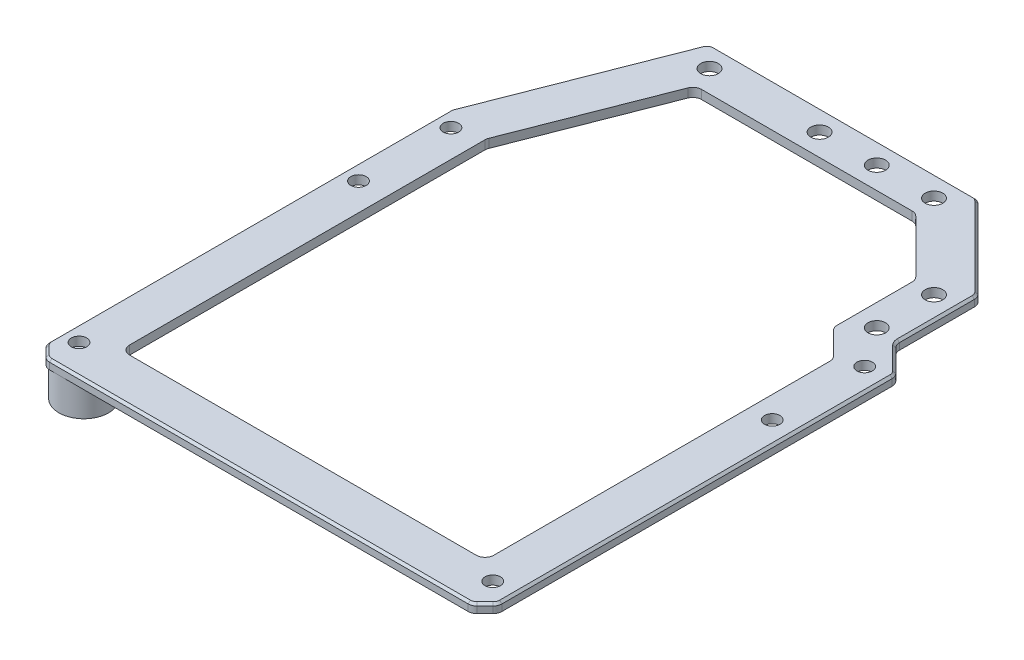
ISO-10303-21;
HEADER;
FILE_DESCRIPTION(('STEP AP214'),'2;1');
FILE_NAME('part.step','',(''),(''),'','','');
FILE_SCHEMA(('AUTOMOTIVE_DESIGN { 1 0 10303 214 1 1 1 1 }'));
ENDSEC;
DATA;
#1=APPLICATION_CONTEXT('core data for automotive mechanical design processes');
#2=APPLICATION_PROTOCOL_DEFINITION('international standard','automotive_design',2000,#1);
#3=PRODUCT_CONTEXT('',#1,'mechanical');
#4=PRODUCT('Part','Part','',(#3));
#5=PRODUCT_RELATED_PRODUCT_CATEGORY('part','',(#4));
#6=PRODUCT_DEFINITION_FORMATION('','',#4);
#7=PRODUCT_DEFINITION_CONTEXT('part definition',#1,'design');
#8=PRODUCT_DEFINITION('design','',#6,#7);
#9=PRODUCT_DEFINITION_SHAPE('','',#8);
#10=(LENGTH_UNIT() NAMED_UNIT(*) SI_UNIT(.MILLI.,.METRE.));
#11=(NAMED_UNIT(*) PLANE_ANGLE_UNIT() SI_UNIT($,.RADIAN.));
#12=(NAMED_UNIT(*) SI_UNIT($,.STERADIAN.) SOLID_ANGLE_UNIT());
#13=UNCERTAINTY_MEASURE_WITH_UNIT(LENGTH_MEASURE(1.E-05),#10,'distance_accuracy_value','');
#14=(GEOMETRIC_REPRESENTATION_CONTEXT(3) GLOBAL_UNCERTAINTY_ASSIGNED_CONTEXT((#13)) GLOBAL_UNIT_ASSIGNED_CONTEXT((#10,
#11,#12)) REPRESENTATION_CONTEXT('',''));
#15=CARTESIAN_POINT('',(0.,0.,0.));
#16=DIRECTION('',(0.,0.,1.));
#17=DIRECTION('',(1.,0.,0.));
#18=AXIS2_PLACEMENT_3D('',#15,#16,#17);
#19=CARTESIAN_POINT('',(0.,2.,0.));
#20=DIRECTION('',(0.,-1.,0.));
#21=DIRECTION('',(0.,0.,-1.));
#22=AXIS2_PLACEMENT_3D('',#19,#20,#21);
#23=PLANE('',#22);
#24=CARTESIAN_POINT('',(46.75,2.,-89.4926406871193));
#25=DIRECTION('',(0.,-1.,0.));
#26=DIRECTION('',(0.,0.,-1.));
#27=AXIS2_PLACEMENT_3D('',#24,#25,#26);
#28=CIRCLE('',#27,1.5);
#29=CARTESIAN_POINT('',(48.25,2.,-89.4926406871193));
#30=VERTEX_POINT('',#29);
#31=CARTESIAN_POINT('',(47.8106601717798,2.,-90.5533008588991));
#32=VERTEX_POINT('',#31);
#33=EDGE_CURVE('E730',#30,#32,#28,.F.);
#34=ORIENTED_EDGE('',*,*,#33,.T.);
#35=DIRECTION('',(-0.707106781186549,0.,-0.707106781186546));
#36=VECTOR('',#35,1.);
#37=CARTESIAN_POINT('',(69.1819805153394,2.,-69.1819805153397));
#38=LINE('',#37,#36);
#39=CARTESIAN_POINT('',(42.7322330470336,2.,-95.6317279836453));
#40=VERTEX_POINT('',#39);
#41=EDGE_CURVE('E736',#32,#40,#38,.T.);
#42=ORIENTED_EDGE('',*,*,#41,.T.);
#43=CARTESIAN_POINT('',(44.5,2.,-97.3994949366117));
#44=DIRECTION('',(0.,-1.,0.));
#45=DIRECTION('',(0.,0.,-1.));
#46=AXIS2_PLACEMENT_3D('',#43,#44,#45);
#47=CIRCLE('',#46,2.5);
#48=CARTESIAN_POINT('',(42.,2.,-97.3994949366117));
#49=VERTEX_POINT('',#48);
#50=EDGE_CURVE('E733',#40,#49,#47,.T.);
#51=ORIENTED_EDGE('',*,*,#50,.T.);
#52=DIRECTION('',(0.,0.,-1.));
#53=VECTOR('',#52,1.);
#54=CARTESIAN_POINT('',(42.,2.,0.));
#55=LINE('',#54,#53);
#56=CARTESIAN_POINT('',(42.,2.,-114.421572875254));
#57=VERTEX_POINT('',#56);
#58=EDGE_CURVE('E727',#49,#57,#55,.T.);
#59=ORIENTED_EDGE('',*,*,#58,.T.);
#60=CARTESIAN_POINT('',(40.5,2.,-114.421572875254));
#61=DIRECTION('',(0.,-1.,0.));
#62=DIRECTION('',(0.,0.,-1.));
#63=AXIS2_PLACEMENT_3D('',#60,#61,#62);
#64=CIRCLE('',#63,1.5);
#65=CARTESIAN_POINT('',(41.5606601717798,2.,-115.482233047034));
#66=VERTEX_POINT('',#65);
#67=EDGE_CURVE('E721',#57,#66,#64,.F.);
#68=ORIENTED_EDGE('',*,*,#67,.T.);
#69=DIRECTION('',(-0.707106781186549,0.,-0.707106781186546));
#70=VECTOR('',#69,1.);
#71=CARTESIAN_POINT('',(78.5214466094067,2.,-78.521446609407));
#72=LINE('',#71,#70);
#73=CARTESIAN_POINT('',(23.7322330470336,2.,-133.31066017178));
#74=VERTEX_POINT('',#73);
#75=EDGE_CURVE('E715',#66,#74,#72,.T.);
#76=ORIENTED_EDGE('',*,*,#75,.T.);
#77=CARTESIAN_POINT('',(22.6715728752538,2.,-132.25));
#78=DIRECTION('',(0.,-1.,0.));
#79=DIRECTION('',(0.,0.,-1.));
#80=AXIS2_PLACEMENT_3D('',#77,#78,#79);
#81=CIRCLE('',#80,1.5);
#82=CARTESIAN_POINT('',(22.6715728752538,2.,-133.75));
#83=VERTEX_POINT('',#82);
#84=EDGE_CURVE('E709',#74,#83,#81,.F.);
#85=ORIENTED_EDGE('',*,*,#84,.T.);
#86=DIRECTION('',(-1.,0.,0.));
#87=VECTOR('',#86,1.);
#88=CARTESIAN_POINT('',(0.,2.,-133.75));
#89=LINE('',#88,#87);
#90=CARTESIAN_POINT('',(-36.1339594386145,2.,-133.75));
#91=VERTEX_POINT('',#90);
#92=EDGE_CURVE('E703',#83,#91,#89,.T.);
#93=ORIENTED_EDGE('',*,*,#92,.T.);
#94=CARTESIAN_POINT('',(-36.1339594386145,2.,-132.25));
#95=DIRECTION('',(0.,-1.,0.));
#96=DIRECTION('',(0.,0.,-1.));
#97=AXIS2_PLACEMENT_3D('',#94,#95,#96);
#98=CIRCLE('',#97,1.5);
#99=CARTESIAN_POINT('',(-37.5311892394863,2.,-132.795663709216));
#100=VERTEX_POINT('',#99);
#101=EDGE_CURVE('E697',#91,#100,#98,.F.);
#102=ORIENTED_EDGE('',*,*,#101,.T.);
#103=DIRECTION('',(-0.36377580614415,0.,0.931486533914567));
#104=VECTOR('',#103,1.);
#105=CARTESIAN_POINT('',(-77.5626918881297,2.,-30.2907554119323));
#106=LINE('',#105,#104);
#107=CARTESIAN_POINT('',(-53.3972298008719,2.,-92.1689840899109));
#108=VERTEX_POINT('',#107);
#109=EDGE_CURVE('E691',#100,#108,#106,.T.);
#110=ORIENTED_EDGE('',*,*,#109,.T.);
#111=CARTESIAN_POINT('',(-52.,2.,-91.6233203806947));
#112=DIRECTION('',(0.,-1.,0.));
#113=DIRECTION('',(0.,0.,-1.));
#114=AXIS2_PLACEMENT_3D('',#111,#112,#113);
#115=CIRCLE('',#114,1.5);
#116=CARTESIAN_POINT('',(-53.5,2.,-91.6233203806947));
#117=VERTEX_POINT('',#116);
#118=EDGE_CURVE('E685',#108,#117,#115,.F.);
#119=ORIENTED_EDGE('',*,*,#118,.T.);
#120=DIRECTION('',(0.,0.,1.));
#121=VECTOR('',#120,1.);
#122=CARTESIAN_POINT('',(-53.5,2.,0.));
#123=LINE('',#122,#121);
#124=CARTESIAN_POINT('',(-53.5,2.,-0.828427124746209));
#125=VERTEX_POINT('',#124);
#126=EDGE_CURVE('E679',#117,#125,#123,.T.);
#127=ORIENTED_EDGE('',*,*,#126,.T.);
#128=CARTESIAN_POINT('',(-52.,2.,-0.828427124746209));
#129=DIRECTION('',(0.,-1.,0.));
#130=DIRECTION('',(0.,0.,-1.));
#131=AXIS2_PLACEMENT_3D('',#128,#129,#130);
#132=CIRCLE('',#131,1.5);
#133=CARTESIAN_POINT('',(-53.0606601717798,2.,0.232233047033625));
#134=VERTEX_POINT('',#133);
#135=EDGE_CURVE('E682',#125,#134,#132,.F.);
#136=ORIENTED_EDGE('',*,*,#135,.T.);
#137=DIRECTION('',(0.707106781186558,0.,0.707106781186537));
#138=VECTOR('',#137,1.);
#139=CARTESIAN_POINT('',(-26.6464466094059,2.,26.6464466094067));
#140=LINE('',#139,#138);
#141=CARTESIAN_POINT('',(-51.2322330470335,2.,2.06066017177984));
#142=VERTEX_POINT('',#141);
#143=EDGE_CURVE('E688',#134,#142,#140,.T.);
#144=ORIENTED_EDGE('',*,*,#143,.T.);
#145=CARTESIAN_POINT('',(-50.1715728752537,2.,1.));
#146=DIRECTION('',(0.,-1.,0.));
#147=DIRECTION('',(0.,0.,-1.));
#148=AXIS2_PLACEMENT_3D('',#145,#146,#147);
#149=CIRCLE('',#148,1.5);
#150=CARTESIAN_POINT('',(-50.1715728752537,2.,2.5));
#151=VERTEX_POINT('',#150);
#152=EDGE_CURVE('E694',#142,#151,#149,.F.);
#153=ORIENTED_EDGE('',*,*,#152,.T.);
#154=DIRECTION('',(1.,0.,0.));
#155=VECTOR('',#154,1.);
#156=CARTESIAN_POINT('',(0.,2.,2.5));
#157=LINE('',#156,#155);
#158=CARTESIAN_POINT('',(44.9215728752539,2.,2.5));
#159=VERTEX_POINT('',#158);
#160=EDGE_CURVE('E700',#151,#159,#157,.T.);
#161=ORIENTED_EDGE('',*,*,#160,.T.);
#162=CARTESIAN_POINT('',(44.9215728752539,2.,1.));
#163=DIRECTION('',(0.,-1.,0.));
#164=DIRECTION('',(0.,0.,-1.));
#165=AXIS2_PLACEMENT_3D('',#162,#163,#164);
#166=CIRCLE('',#165,1.5);
#167=CARTESIAN_POINT('',(45.9822330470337,2.,2.0606601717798));
#168=VERTEX_POINT('',#167);
#169=EDGE_CURVE('E706',#159,#168,#166,.F.);
#170=ORIENTED_EDGE('',*,*,#169,.T.);
#171=DIRECTION('',(0.707106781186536,0.,-0.707106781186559));
#172=VECTOR('',#171,1.);
#173=CARTESIAN_POINT('',(24.0214466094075,2.,24.0214466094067));
#174=LINE('',#173,#172);
#175=CARTESIAN_POINT('',(47.8106601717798,2.,0.232233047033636));
#176=VERTEX_POINT('',#175);
#177=EDGE_CURVE('E712',#168,#176,#174,.T.);
#178=ORIENTED_EDGE('',*,*,#177,.T.);
#179=CARTESIAN_POINT('',(46.75,2.,-0.828427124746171));
#180=DIRECTION('',(0.,-1.,0.));
#181=DIRECTION('',(0.,0.,-1.));
#182=AXIS2_PLACEMENT_3D('',#179,#180,#181);
#183=CIRCLE('',#182,1.5);
#184=CARTESIAN_POINT('',(48.25,2.,-0.828427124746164));
#185=VERTEX_POINT('',#184);
#186=EDGE_CURVE('E718',#176,#185,#183,.F.);
#187=ORIENTED_EDGE('',*,*,#186,.T.);
#188=DIRECTION('',(0.,0.,-1.));
#189=VECTOR('',#188,1.);
#190=CARTESIAN_POINT('',(48.25,2.,0.));
#191=LINE('',#190,#189);
#192=EDGE_CURVE('E724',#185,#30,#191,.T.);
#193=ORIENTED_EDGE('',*,*,#192,.T.);
#194=EDGE_LOOP('',(#34,#42,#51,#59,#68,#76,#85,#93,#102,#110,#119,#127,#136,#144,#153,#161,#170,
#178,#187,#193));
#195=FACE_BOUND('',#194,.T.);
#196=DIRECTION('',(0.,0.,-1.));
#197=VECTOR('',#196,1.);
#198=CARTESIAN_POINT('',(32.5,2.,-92.4289321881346));
#199=LINE('',#198,#197);
#200=CARTESIAN_POINT('',(32.5,2.,-93.2573593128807));
#201=VERTEX_POINT('',#200);
#202=CARTESIAN_POINT('',(32.5,2.,-110.279437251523));
#203=VERTEX_POINT('',#202);
#204=EDGE_CURVE('E892',#201,#203,#199,.T.);
#205=ORIENTED_EDGE('',*,*,#204,.F.);
#206=CARTESIAN_POINT('',(34.5,2.,-93.2573593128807));
#207=DIRECTION('',(0.,-1.,0.));
#208=DIRECTION('',(0.,0.,-1.));
#209=AXIS2_PLACEMENT_3D('',#206,#207,#208);
#210=CIRCLE('',#209,2.);
#211=CARTESIAN_POINT('',(33.0857864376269,2.,-91.8431457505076));
#212=VERTEX_POINT('',#211);
#213=EDGE_CURVE('E516',#201,#212,#210,.F.);
#214=ORIENTED_EDGE('',*,*,#213,.T.);
#215=DIRECTION('',(-0.707106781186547,0.,-0.707106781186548));
#216=VECTOR('',#215,1.);
#217=CARTESIAN_POINT('',(38.75,2.,-86.1789321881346));
#218=LINE('',#217,#216);
#219=CARTESIAN_POINT('',(38.1642135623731,2.,-86.7647186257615));
#220=VERTEX_POINT('',#219);
#221=EDGE_CURVE('E391',#220,#212,#218,.T.);
#222=ORIENTED_EDGE('',*,*,#221,.F.);
#223=CARTESIAN_POINT('',(36.75,2.,-85.3505050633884));
#224=DIRECTION('',(0.,-1.,0.));
#225=DIRECTION('',(0.,0.,-1.));
#226=AXIS2_PLACEMENT_3D('',#223,#224,#225);
#227=CIRCLE('',#226,2.);
#228=CARTESIAN_POINT('',(38.75,2.,-85.3505050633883));
#229=VERTEX_POINT('',#228);
#230=EDGE_CURVE('E645',#220,#229,#227,.T.);
#231=ORIENTED_EDGE('',*,*,#230,.T.);
#232=DIRECTION('',(0.,0.,-1.));
#233=VECTOR('',#232,1.);
#234=CARTESIAN_POINT('',(38.75,2.,-7.));
#235=LINE('',#234,#233);
#236=CARTESIAN_POINT('',(38.75,2.,-9.));
#237=VERTEX_POINT('',#236);
#238=EDGE_CURVE('E421',#237,#229,#235,.T.);
#239=ORIENTED_EDGE('',*,*,#238,.F.);
#240=CARTESIAN_POINT('',(36.75,2.,-9.));
#241=DIRECTION('',(0.,-1.,0.));
#242=DIRECTION('',(0.,0.,-1.));
#243=AXIS2_PLACEMENT_3D('',#240,#241,#242);
#244=CIRCLE('',#243,2.);
#245=CARTESIAN_POINT('',(36.75,2.,-7.));
#246=VERTEX_POINT('',#245);
#247=EDGE_CURVE('E633',#237,#246,#244,.T.);
#248=ORIENTED_EDGE('',*,*,#247,.T.);
#249=DIRECTION('',(1.,0.,0.));
#250=VECTOR('',#249,1.);
#251=CARTESIAN_POINT('',(-44.,2.,-7.));
#252=LINE('',#251,#250);
#253=CARTESIAN_POINT('',(-42.,2.,-7.));
#254=VERTEX_POINT('',#253);
#255=EDGE_CURVE('E417',#254,#246,#252,.T.);
#256=ORIENTED_EDGE('',*,*,#255,.F.);
#257=CARTESIAN_POINT('',(-42.,2.,-9.));
#258=DIRECTION('',(0.,-1.,0.));
#259=DIRECTION('',(0.,0.,-1.));
#260=AXIS2_PLACEMENT_3D('',#257,#258,#259);
#261=CIRCLE('',#260,2.);
#262=CARTESIAN_POINT('',(-44.,2.,-8.99999999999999));
#263=VERTEX_POINT('',#262);
#264=EDGE_CURVE('E639',#254,#263,#261,.T.);
#265=ORIENTED_EDGE('',*,*,#264,.T.);
#266=DIRECTION('',(0.,0.,1.));
#267=VECTOR('',#266,1.);
#268=CARTESIAN_POINT('',(-44.,2.,-90.1166019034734));
#269=LINE('',#268,#267);
#270=CARTESIAN_POINT('',(-44.,2.,-89.7399222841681));
#271=VERTEX_POINT('',#270);
#272=EDGE_CURVE('E412',#271,#263,#269,.T.);
#273=ORIENTED_EDGE('',*,*,#272,.F.);
#274=CARTESIAN_POINT('',(-42.,2.,-89.7399222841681));
#275=DIRECTION('',(0.,-1.,0.));
#276=DIRECTION('',(0.,0.,-1.));
#277=AXIS2_PLACEMENT_3D('',#274,#275,#276);
#278=CIRCLE('',#277,2.);
#279=CARTESIAN_POINT('',(-43.8629730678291,2.,-90.4674738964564));
#280=VERTEX_POINT('',#279);
#281=EDGE_CURVE('E663',#271,#280,#278,.T.);
#282=ORIENTED_EDGE('',*,*,#281,.T.);
#283=DIRECTION('',(-0.363775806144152,0.,0.931486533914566));
#284=VECTOR('',#283,1.);
#285=CARTESIAN_POINT('',(-43.2644717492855,2.,-92.));
#286=LINE('',#285,#284);
#287=CARTESIAN_POINT('',(-31.166729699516,2.,-122.977551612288));
#288=VERTEX_POINT('',#287);
#289=EDGE_CURVE('E408',#288,#280,#286,.T.);
#290=ORIENTED_EDGE('',*,*,#289,.F.);
#291=CARTESIAN_POINT('',(-29.3037566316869,2.,-122.25));
#292=DIRECTION('',(0.,-1.,0.));
#293=DIRECTION('',(0.,0.,-1.));
#294=AXIS2_PLACEMENT_3D('',#291,#292,#293);
#295=CIRCLE('',#294,2.);
#296=CARTESIAN_POINT('',(-29.3037566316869,2.,-124.25));
#297=VERTEX_POINT('',#296);
#298=EDGE_CURVE('E672',#288,#297,#295,.T.);
#299=ORIENTED_EDGE('',*,*,#298,.T.);
#300=DIRECTION('',(-1.,0.,0.));
#301=VECTOR('',#300,1.);
#302=CARTESIAN_POINT('',(19.357864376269,2.,-124.25));
#303=LINE('',#302,#301);
#304=CARTESIAN_POINT('',(18.5294372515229,2.,-124.25));
#305=VERTEX_POINT('',#304);
#306=EDGE_CURVE('E886',#305,#297,#303,.T.);
#307=ORIENTED_EDGE('',*,*,#306,.F.);
#308=CARTESIAN_POINT('',(18.5294372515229,2.,-122.25));
#309=DIRECTION('',(0.,-1.,0.));
#310=DIRECTION('',(0.,0.,-1.));
#311=AXIS2_PLACEMENT_3D('',#308,#309,#310);
#312=CIRCLE('',#311,2.);
#313=CARTESIAN_POINT('',(19.9436508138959,2.,-123.664213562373));
#314=VERTEX_POINT('',#313);
#315=EDGE_CURVE('E660',#305,#314,#312,.T.);
#316=ORIENTED_EDGE('',*,*,#315,.T.);
#317=DIRECTION('',(-0.707106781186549,0.,-0.707106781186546));
#318=VECTOR('',#317,1.);
#319=CARTESIAN_POINT('',(32.5,2.,-111.107864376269));
#320=LINE('',#319,#318);
#321=CARTESIAN_POINT('',(31.9142135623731,2.,-111.693650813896));
#322=VERTEX_POINT('',#321);
#323=EDGE_CURVE('E1076',#322,#314,#320,.T.);
#324=ORIENTED_EDGE('',*,*,#323,.F.);
#325=CARTESIAN_POINT('',(30.5,2.,-110.279437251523));
#326=DIRECTION('',(0.,-1.,0.));
#327=DIRECTION('',(0.,0.,-1.));
#328=AXIS2_PLACEMENT_3D('',#325,#326,#327);
#329=CIRCLE('',#328,2.);
#330=EDGE_CURVE('E654',#322,#203,#329,.T.);
#331=ORIENTED_EDGE('',*,*,#330,.T.);
#332=EDGE_LOOP('',(#205,#214,#222,#231,#239,#248,#256,#265,#273,#282,#290,#299,#307,#316,#324,#331));
#333=FACE_BOUND('',#332,.T.);
#334=CARTESIAN_POINT('',(-50.25,2.,-88.25));
#335=DIRECTION('',(0.,1.,0.));
#336=DIRECTION('',(0.,0.,1.));
#337=AXIS2_PLACEMENT_3D('',#334,#335,#336);
#338=CIRCLE('',#337,1.75);
#339=CARTESIAN_POINT('',(-50.25,2.,-86.5));
#340=VERTEX_POINT('',#339);
#341=EDGE_CURVE('E474',#340,#340,#338,.T.);
#342=ORIENTED_EDGE('',*,*,#341,.F.);
#343=EDGE_LOOP('',(#342));
#344=FACE_BOUND('',#343,.T.);
#345=CARTESIAN_POINT('',(-50.25,2.,-67.25));
#346=DIRECTION('',(0.,1.,0.));
#347=DIRECTION('',(0.,0.,1.));
#348=AXIS2_PLACEMENT_3D('',#345,#346,#347);
#349=CIRCLE('',#348,1.75);
#350=CARTESIAN_POINT('',(-50.25,2.,-65.5));
#351=VERTEX_POINT('',#350);
#352=EDGE_CURVE('E466',#351,#351,#349,.T.);
#353=ORIENTED_EDGE('',*,*,#352,.F.);
#354=EDGE_LOOP('',(#353));
#355=FACE_BOUND('',#354,.T.);
#356=CARTESIAN_POINT('',(-50.25,2.,-3.75));
#357=DIRECTION('',(0.,1.,0.));
#358=DIRECTION('',(0.,0.,1.));
#359=AXIS2_PLACEMENT_3D('',#356,#357,#358);
#360=CIRCLE('',#359,1.75);
#361=CARTESIAN_POINT('',(-50.25,2.,-2.));
#362=VERTEX_POINT('',#361);
#363=EDGE_CURVE('E458',#362,#362,#360,.T.);
#364=ORIENTED_EDGE('',*,*,#363,.F.);
#365=EDGE_LOOP('',(#364));
#366=FACE_BOUND('',#365,.T.);
#367=CARTESIAN_POINT('',(43.75,2.,-3.75));
#368=DIRECTION('',(0.,1.,0.));
#369=DIRECTION('',(0.,0.,1.));
#370=AXIS2_PLACEMENT_3D('',#367,#368,#369);
#371=CIRCLE('',#370,1.75);
#372=CARTESIAN_POINT('',(43.75,2.,-2.00000000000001));
#373=VERTEX_POINT('',#372);
#374=EDGE_CURVE('E450',#373,#373,#371,.T.);
#375=ORIENTED_EDGE('',*,*,#374,.F.);
#376=EDGE_LOOP('',(#375));
#377=FACE_BOUND('',#376,.T.);
#378=CARTESIAN_POINT('',(43.75,2.,-67.25));
#379=DIRECTION('',(0.,1.,0.));
#380=DIRECTION('',(0.,0.,1.));
#381=AXIS2_PLACEMENT_3D('',#378,#379,#380);
#382=CIRCLE('',#381,1.75);
#383=CARTESIAN_POINT('',(43.75,2.,-65.5));
#384=VERTEX_POINT('',#383);
#385=EDGE_CURVE('E442',#384,#384,#382,.T.);
#386=ORIENTED_EDGE('',*,*,#385,.F.);
#387=EDGE_LOOP('',(#386));
#388=FACE_BOUND('',#387,.T.);
#389=CARTESIAN_POINT('',(43.75,2.,-88.25));
#390=DIRECTION('',(0.,1.,0.));
#391=DIRECTION('',(0.,0.,1.));
#392=AXIS2_PLACEMENT_3D('',#389,#390,#391);
#393=CIRCLE('',#392,1.75);
#394=CARTESIAN_POINT('',(43.75,2.,-86.5));
#395=VERTEX_POINT('',#394);
#396=EDGE_CURVE('E434',#395,#395,#393,.T.);
#397=ORIENTED_EDGE('',*,*,#396,.F.);
#398=EDGE_LOOP('',(#397));
#399=FACE_BOUND('',#398,.T.);
#400=CARTESIAN_POINT('',(-32.5,2.,-129.25));
#401=DIRECTION('',(0.,1.,0.));
#402=DIRECTION('',(0.,0.,1.));
#403=AXIS2_PLACEMENT_3D('',#400,#401,#402);
#404=CIRCLE('',#403,2.);
#405=CARTESIAN_POINT('',(-32.5,2.,-127.25));
#406=VERTEX_POINT('',#405);
#407=EDGE_CURVE('E893',#406,#406,#404,.T.);
#408=ORIENTED_EDGE('',*,*,#407,.F.);
#409=EDGE_LOOP('',(#408));
#410=FACE_BOUND('',#409,.T.);
#411=CARTESIAN_POINT('',(5.49999999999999,2.,-129.25));
#412=DIRECTION('',(0.,1.,0.));
#413=DIRECTION('',(0.,0.,1.));
#414=AXIS2_PLACEMENT_3D('',#411,#412,#413);
#415=CIRCLE('',#414,2.);
#416=CARTESIAN_POINT('',(5.49999999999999,2.,-127.25));
#417=VERTEX_POINT('',#416);
#418=EDGE_CURVE('E910',#417,#417,#415,.T.);
#419=ORIENTED_EDGE('',*,*,#418,.F.);
#420=EDGE_LOOP('',(#419));
#421=FACE_BOUND('',#420,.T.);
#422=CARTESIAN_POINT('',(37.5,2.,-110.25));
#423=DIRECTION('',(0.,1.,0.));
#424=DIRECTION('',(0.,0.,1.));
#425=AXIS2_PLACEMENT_3D('',#422,#423,#424);
#426=CIRCLE('',#425,2.);
#427=CARTESIAN_POINT('',(37.5,2.,-108.25));
#428=VERTEX_POINT('',#427);
#429=EDGE_CURVE('E926',#428,#428,#426,.T.);
#430=ORIENTED_EDGE('',*,*,#429,.F.);
#431=EDGE_LOOP('',(#430));
#432=FACE_BOUND('',#431,.T.);
#433=CARTESIAN_POINT('',(37.5,2.,-97.25));
#434=DIRECTION('',(0.,1.,0.));
#435=DIRECTION('',(0.,0.,1.));
#436=AXIS2_PLACEMENT_3D('',#433,#434,#435);
#437=CIRCLE('',#436,2.);
#438=CARTESIAN_POINT('',(37.5,2.,-95.25));
#439=VERTEX_POINT('',#438);
#440=EDGE_CURVE('E934',#439,#439,#437,.T.);
#441=ORIENTED_EDGE('',*,*,#440,.F.);
#442=EDGE_LOOP('',(#441));
#443=FACE_BOUND('',#442,.T.);
#444=CARTESIAN_POINT('',(18.5,2.,-129.25));
#445=DIRECTION('',(0.,1.,0.));
#446=DIRECTION('',(0.,0.,1.));
#447=AXIS2_PLACEMENT_3D('',#444,#445,#446);
#448=CIRCLE('',#447,2.00000000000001);
#449=CARTESIAN_POINT('',(18.5,2.,-127.25));
#450=VERTEX_POINT('',#449);
#451=EDGE_CURVE('E918',#450,#450,#448,.T.);
#452=ORIENTED_EDGE('',*,*,#451,.F.);
#453=EDGE_LOOP('',(#452));
#454=FACE_BOUND('',#453,.T.);
#455=CARTESIAN_POINT('',(-7.50000000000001,2.,-129.25));
#456=DIRECTION('',(0.,1.,0.));
#457=DIRECTION('',(0.,0.,1.));
#458=AXIS2_PLACEMENT_3D('',#455,#456,#457);
#459=CIRCLE('',#458,2.);
#460=CARTESIAN_POINT('',(-7.50000000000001,2.,-127.25));
#461=VERTEX_POINT('',#460);
#462=EDGE_CURVE('E902',#461,#461,#459,.T.);
#463=ORIENTED_EDGE('',*,*,#462,.F.);
#464=EDGE_LOOP('',(#463));
#465=FACE_BOUND('',#464,.T.);
#466=ADVANCED_FACE('F41',(#195,#333,#344,#355,#366,#377,#388,#399,#410,#421,#432,#443,#454,
#465),#23,.F.);
#467=CARTESIAN_POINT('',(0.,0.,0.));
#468=DIRECTION('',(0.,-1.,0.));
#469=DIRECTION('',(0.,0.,-1.));
#470=AXIS2_PLACEMENT_3D('',#467,#468,#469);
#471=PLANE('',#470);
#472=DIRECTION('',(-0.707106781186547,0.,-0.707106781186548));
#473=VECTOR('',#472,1.);
#474=CARTESIAN_POINT('',(38.75,0.,-86.1789321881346));
#475=LINE('',#474,#473);
#476=CARTESIAN_POINT('',(38.1642135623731,0.,-86.7647186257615));
#477=VERTEX_POINT('',#476);
#478=CARTESIAN_POINT('',(33.0857864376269,0.,-91.8431457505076));
#479=VERTEX_POINT('',#478);
#480=EDGE_CURVE('E403',#477,#479,#475,.T.);
#481=ORIENTED_EDGE('',*,*,#480,.T.);
#482=CARTESIAN_POINT('',(34.5,0.,-93.2573593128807));
#483=DIRECTION('',(0.,-1.,0.));
#484=DIRECTION('',(0.,0.,-1.));
#485=AXIS2_PLACEMENT_3D('',#482,#483,#484);
#486=CIRCLE('',#485,2.);
#487=CARTESIAN_POINT('',(32.5,0.,-93.2573593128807));
#488=VERTEX_POINT('',#487);
#489=EDGE_CURVE('E352',#479,#488,#486,.T.);
#490=ORIENTED_EDGE('',*,*,#489,.T.);
#491=DIRECTION('',(0.,0.,-1.));
#492=VECTOR('',#491,1.);
#493=CARTESIAN_POINT('',(32.5,0.,-92.4289321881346));
#494=LINE('',#493,#492);
#495=CARTESIAN_POINT('',(32.5,0.,-110.279437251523));
#496=VERTEX_POINT('',#495);
#497=EDGE_CURVE('E870',#488,#496,#494,.T.);
#498=ORIENTED_EDGE('',*,*,#497,.T.);
#499=CARTESIAN_POINT('',(30.5,0.,-110.279437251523));
#500=DIRECTION('',(0.,-1.,0.));
#501=DIRECTION('',(0.,0.,-1.));
#502=AXIS2_PLACEMENT_3D('',#499,#500,#501);
#503=CIRCLE('',#502,2.);
#504=CARTESIAN_POINT('',(31.9142135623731,0.,-111.693650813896));
#505=VERTEX_POINT('',#504);
#506=EDGE_CURVE('E651',#496,#505,#503,.F.);
#507=ORIENTED_EDGE('',*,*,#506,.T.);
#508=DIRECTION('',(-0.707106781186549,0.,-0.707106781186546));
#509=VECTOR('',#508,1.);
#510=CARTESIAN_POINT('',(32.5,0.,-111.107864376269));
#511=LINE('',#510,#509);
#512=CARTESIAN_POINT('',(19.9436508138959,0.,-123.664213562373));
#513=VERTEX_POINT('',#512);
#514=EDGE_CURVE('E877',#505,#513,#511,.T.);
#515=ORIENTED_EDGE('',*,*,#514,.T.);
#516=CARTESIAN_POINT('',(18.5294372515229,0.,-122.25));
#517=DIRECTION('',(0.,-1.,0.));
#518=DIRECTION('',(0.,0.,-1.));
#519=AXIS2_PLACEMENT_3D('',#516,#517,#518);
#520=CIRCLE('',#519,2.);
#521=CARTESIAN_POINT('',(18.5294372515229,0.,-124.25));
#522=VERTEX_POINT('',#521);
#523=EDGE_CURVE('E657',#513,#522,#520,.F.);
#524=ORIENTED_EDGE('',*,*,#523,.T.);
#525=DIRECTION('',(-1.,0.,0.));
#526=VECTOR('',#525,1.);
#527=CARTESIAN_POINT('',(19.357864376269,0.,-124.25));
#528=LINE('',#527,#526);
#529=CARTESIAN_POINT('',(-29.3037566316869,0.,-124.25));
#530=VERTEX_POINT('',#529);
#531=EDGE_CURVE('E883',#522,#530,#528,.T.);
#532=ORIENTED_EDGE('',*,*,#531,.T.);
#533=CARTESIAN_POINT('',(-29.3037566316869,0.,-122.25));
#534=DIRECTION('',(0.,-1.,0.));
#535=DIRECTION('',(0.,0.,-1.));
#536=AXIS2_PLACEMENT_3D('',#533,#534,#535);
#537=CIRCLE('',#536,2.);
#538=CARTESIAN_POINT('',(-31.166729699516,0.,-122.977551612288));
#539=VERTEX_POINT('',#538);
#540=EDGE_CURVE('E669',#530,#539,#537,.F.);
#541=ORIENTED_EDGE('',*,*,#540,.T.);
#542=DIRECTION('',(-0.363775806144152,0.,0.931486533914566));
#543=VECTOR('',#542,1.);
#544=CARTESIAN_POINT('',(-43.2644717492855,0.,-92.));
#545=LINE('',#544,#543);
#546=CARTESIAN_POINT('',(-43.8629730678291,0.,-90.4674738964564));
#547=VERTEX_POINT('',#546);
#548=EDGE_CURVE('E386',#539,#547,#545,.T.);
#549=ORIENTED_EDGE('',*,*,#548,.T.);
#550=CARTESIAN_POINT('',(-42.,0.,-89.7399222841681));
#551=DIRECTION('',(0.,-1.,0.));
#552=DIRECTION('',(0.,0.,-1.));
#553=AXIS2_PLACEMENT_3D('',#550,#551,#552);
#554=CIRCLE('',#553,2.);
#555=CARTESIAN_POINT('',(-44.,0.,-89.7399222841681));
#556=VERTEX_POINT('',#555);
#557=EDGE_CURVE('E666',#547,#556,#554,.F.);
#558=ORIENTED_EDGE('',*,*,#557,.T.);
#559=DIRECTION('',(0.,0.,1.));
#560=VECTOR('',#559,1.);
#561=CARTESIAN_POINT('',(-44.,0.,-90.1166019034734));
#562=LINE('',#561,#560);
#563=CARTESIAN_POINT('',(-44.,0.,-8.99999999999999));
#564=VERTEX_POINT('',#563);
#565=EDGE_CURVE('E390',#556,#564,#562,.T.);
#566=ORIENTED_EDGE('',*,*,#565,.T.);
#567=CARTESIAN_POINT('',(-42.,0.,-9.));
#568=DIRECTION('',(0.,-1.,0.));
#569=DIRECTION('',(0.,0.,-1.));
#570=AXIS2_PLACEMENT_3D('',#567,#568,#569);
#571=CIRCLE('',#570,2.);
#572=CARTESIAN_POINT('',(-42.,0.,-7.));
#573=VERTEX_POINT('',#572);
#574=EDGE_CURVE('E642',#564,#573,#571,.F.);
#575=ORIENTED_EDGE('',*,*,#574,.T.);
#576=DIRECTION('',(1.,0.,0.));
#577=VECTOR('',#576,1.);
#578=CARTESIAN_POINT('',(-44.,0.,-7.));
#579=LINE('',#578,#577);
#580=CARTESIAN_POINT('',(36.75,0.,-7.));
#581=VERTEX_POINT('',#580);
#582=EDGE_CURVE('E395',#573,#581,#579,.T.);
#583=ORIENTED_EDGE('',*,*,#582,.T.);
#584=CARTESIAN_POINT('',(36.75,0.,-9.));
#585=DIRECTION('',(0.,-1.,0.));
#586=DIRECTION('',(0.,0.,-1.));
#587=AXIS2_PLACEMENT_3D('',#584,#585,#586);
#588=CIRCLE('',#587,2.);
#589=CARTESIAN_POINT('',(38.75,0.,-9.));
#590=VERTEX_POINT('',#589);
#591=EDGE_CURVE('E636',#581,#590,#588,.F.);
#592=ORIENTED_EDGE('',*,*,#591,.T.);
#593=DIRECTION('',(0.,0.,-1.));
#594=VECTOR('',#593,1.);
#595=CARTESIAN_POINT('',(38.75,0.,-7.));
#596=LINE('',#595,#594);
#597=CARTESIAN_POINT('',(38.75,0.,-85.3505050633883));
#598=VERTEX_POINT('',#597);
#599=EDGE_CURVE('E399',#590,#598,#596,.T.);
#600=ORIENTED_EDGE('',*,*,#599,.T.);
#601=CARTESIAN_POINT('',(36.75,0.,-85.3505050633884));
#602=DIRECTION('',(0.,-1.,0.));
#603=DIRECTION('',(0.,0.,-1.));
#604=AXIS2_PLACEMENT_3D('',#601,#602,#603);
#605=CIRCLE('',#604,2.);
#606=EDGE_CURVE('E648',#598,#477,#605,.F.);
#607=ORIENTED_EDGE('',*,*,#606,.T.);
#608=EDGE_LOOP('',(#481,#490,#498,#507,#515,#524,#532,#541,#549,#558,#566,#575,#583,#592,#600,#607));
#609=FACE_BOUND('',#608,.T.);
#610=DIRECTION('',(1.,0.,0.));
#611=VECTOR('',#610,1.);
#612=CARTESIAN_POINT('',(-50.9999999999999,0.,3.));
#613=LINE('',#612,#611);
#614=CARTESIAN_POINT('',(-48.0613481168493,0.,3.));
#615=VERTEX_POINT('',#614);
#616=CARTESIAN_POINT('',(44.9215728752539,0.,3.));
#617=VERTEX_POINT('',#616);
#618=EDGE_CURVE('E945',#615,#617,#613,.T.);
#619=ORIENTED_EDGE('',*,*,#618,.F.);
#620=CARTESIAN_POINT('',(-48.0613481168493,0.,-2.6493724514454));
#621=DIRECTION('',(0.,-1.,0.));
#622=DIRECTION('',(0.,0.,-1.));
#623=AXIS2_PLACEMENT_3D('',#620,#621,#622);
#624=CIRCLE('',#623,5.6493724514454);
#625=EDGE_CURVE('E58',#615,#615,#624,.T.);
#626=ORIENTED_EDGE('',*,*,#625,.F.);
#627=CARTESIAN_POINT('',(-50.1715728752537,0.,3.));
#628=VERTEX_POINT('',#627);
#629=EDGE_CURVE('E946',#628,#615,#613,.T.);
#630=ORIENTED_EDGE('',*,*,#629,.F.);
#631=CARTESIAN_POINT('',(-50.1715728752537,0.,1.));
#632=DIRECTION('',(0.,-1.,0.));
#633=DIRECTION('',(0.,0.,-1.));
#634=AXIS2_PLACEMENT_3D('',#631,#632,#633);
#635=CIRCLE('',#634,2.);
#636=CARTESIAN_POINT('',(-51.5857864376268,0.,2.41421356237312));
#637=VERTEX_POINT('',#636);
#638=EDGE_CURVE('E496',#628,#637,#635,.T.);
#639=ORIENTED_EDGE('',*,*,#638,.T.);
#640=DIRECTION('',(0.707106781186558,0.,0.707106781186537));
#641=VECTOR('',#640,1.);
#642=CARTESIAN_POINT('',(-54.,0.,0.));
#643=LINE('',#642,#641);
#644=CARTESIAN_POINT('',(-53.4142135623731,0.,0.585786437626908));
#645=VERTEX_POINT('',#644);
#646=EDGE_CURVE('E938',#645,#637,#643,.T.);
#647=ORIENTED_EDGE('',*,*,#646,.F.);
#648=CARTESIAN_POINT('',(-52.,0.,-0.828427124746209));
#649=DIRECTION('',(0.,-1.,0.));
#650=DIRECTION('',(0.,0.,-1.));
#651=AXIS2_PLACEMENT_3D('',#648,#649,#650);
#652=CIRCLE('',#651,2.);
#653=CARTESIAN_POINT('',(-54.,0.,-0.828427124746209));
#654=VERTEX_POINT('',#653);
#655=EDGE_CURVE('E499',#645,#654,#652,.T.);
#656=ORIENTED_EDGE('',*,*,#655,.T.);
#657=DIRECTION('',(0.,0.,1.));
#658=VECTOR('',#657,1.);
#659=CARTESIAN_POINT('',(-54.,0.,0.));
#660=LINE('',#659,#658);
#661=CARTESIAN_POINT('',(-54.,0.,-91.6233203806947));
#662=VERTEX_POINT('',#661);
#663=EDGE_CURVE('E478',#662,#654,#660,.T.);
#664=ORIENTED_EDGE('',*,*,#663,.F.);
#665=CARTESIAN_POINT('',(-52.,0.,-91.6233203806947));
#666=DIRECTION('',(0.,-1.,0.));
#667=DIRECTION('',(0.,0.,-1.));
#668=AXIS2_PLACEMENT_3D('',#665,#666,#667);
#669=CIRCLE('',#668,2.);
#670=CARTESIAN_POINT('',(-53.8629730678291,0.,-92.350871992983));
#671=VERTEX_POINT('',#670);
#672=EDGE_CURVE('E502',#662,#671,#669,.T.);
#673=ORIENTED_EDGE('',*,*,#672,.T.);
#674=DIRECTION('',(-0.36377580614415,0.,0.931486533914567));
#675=VECTOR('',#674,1.);
#676=CARTESIAN_POINT('',(-37.5,0.,-134.25));
#677=LINE('',#676,#675);
#678=CARTESIAN_POINT('',(-37.9969325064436,0.,-132.977551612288));
#679=VERTEX_POINT('',#678);
#680=EDGE_CURVE('E374',#679,#671,#677,.T.);
#681=ORIENTED_EDGE('',*,*,#680,.F.);
#682=CARTESIAN_POINT('',(-36.1339594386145,0.,-132.25));
#683=DIRECTION('',(0.,-1.,0.));
#684=DIRECTION('',(0.,0.,-1.));
#685=AXIS2_PLACEMENT_3D('',#682,#683,#684);
#686=CIRCLE('',#685,2.);
#687=CARTESIAN_POINT('',(-36.1339594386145,0.,-134.25));
#688=VERTEX_POINT('',#687);
#689=EDGE_CURVE('E372',#679,#688,#686,.T.);
#690=ORIENTED_EDGE('',*,*,#689,.T.);
#691=DIRECTION('',(-1.,0.,0.));
#692=VECTOR('',#691,1.);
#693=CARTESIAN_POINT('',(23.5,0.,-134.25));
#694=LINE('',#693,#692);
#695=CARTESIAN_POINT('',(22.6715728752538,0.,-134.25));
#696=VERTEX_POINT('',#695);
#697=EDGE_CURVE('E345',#696,#688,#694,.T.);
#698=ORIENTED_EDGE('',*,*,#697,.F.);
#699=CARTESIAN_POINT('',(22.6715728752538,0.,-132.25));
#700=DIRECTION('',(0.,-1.,0.));
#701=DIRECTION('',(0.,0.,-1.));
#702=AXIS2_PLACEMENT_3D('',#699,#700,#701);
#703=CIRCLE('',#702,2.);
#704=CARTESIAN_POINT('',(24.0857864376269,0.,-133.664213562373));
#705=VERTEX_POINT('',#704);
#706=EDGE_CURVE('E356',#696,#705,#703,.T.);
#707=ORIENTED_EDGE('',*,*,#706,.T.);
#708=DIRECTION('',(-0.707106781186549,0.,-0.707106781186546));
#709=VECTOR('',#708,1.);
#710=CARTESIAN_POINT('',(42.5,0.,-115.25));
#711=LINE('',#710,#709);
#712=CARTESIAN_POINT('',(41.9142135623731,0.,-115.835786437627));
#713=VERTEX_POINT('',#712);
#714=EDGE_CURVE('E375',#713,#705,#711,.T.);
#715=ORIENTED_EDGE('',*,*,#714,.F.);
#716=CARTESIAN_POINT('',(40.5,0.,-114.421572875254));
#717=DIRECTION('',(0.,-1.,0.));
#718=DIRECTION('',(0.,0.,-1.));
#719=AXIS2_PLACEMENT_3D('',#716,#717,#718);
#720=CIRCLE('',#719,2.);
#721=CARTESIAN_POINT('',(42.5,0.,-114.421572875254));
#722=VERTEX_POINT('',#721);
#723=EDGE_CURVE('E365',#713,#722,#720,.T.);
#724=ORIENTED_EDGE('',*,*,#723,.T.);
#725=DIRECTION('',(0.,0.,-1.));
#726=VECTOR('',#725,1.);
#727=CARTESIAN_POINT('',(42.5,0.,-96.5710678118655));
#728=LINE('',#727,#726);
#729=CARTESIAN_POINT('',(42.5,0.,-97.3994949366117));
#730=VERTEX_POINT('',#729);
#731=EDGE_CURVE('E382',#730,#722,#728,.T.);
#732=ORIENTED_EDGE('',*,*,#731,.F.);
#733=CARTESIAN_POINT('',(44.5,0.,-97.3994949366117));
#734=DIRECTION('',(0.,-1.,0.));
#735=DIRECTION('',(0.,0.,-1.));
#736=AXIS2_PLACEMENT_3D('',#733,#734,#735);
#737=CIRCLE('',#736,2.);
#738=CARTESIAN_POINT('',(43.0857864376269,0.,-95.9852813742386));
#739=VERTEX_POINT('',#738);
#740=EDGE_CURVE('E630',#730,#739,#737,.F.);
#741=ORIENTED_EDGE('',*,*,#740,.T.);
#742=DIRECTION('',(0.707106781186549,0.,0.707106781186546));
#743=VECTOR('',#742,1.);
#744=CARTESIAN_POINT('',(47.0710678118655,0.,-92.));
#745=LINE('',#744,#743);
#746=CARTESIAN_POINT('',(48.1642135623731,0.,-90.9068542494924));
#747=VERTEX_POINT('',#746);
#748=EDGE_CURVE('E380',#739,#747,#745,.T.);
#749=ORIENTED_EDGE('',*,*,#748,.T.);
#750=CARTESIAN_POINT('',(46.75,0.,-89.4926406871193));
#751=DIRECTION('',(0.,-1.,0.));
#752=DIRECTION('',(0.,0.,-1.));
#753=AXIS2_PLACEMENT_3D('',#750,#751,#752);
#754=CIRCLE('',#753,2.);
#755=CARTESIAN_POINT('',(48.75,0.,-89.4926406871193));
#756=VERTEX_POINT('',#755);
#757=EDGE_CURVE('E507',#747,#756,#754,.T.);
#758=ORIENTED_EDGE('',*,*,#757,.T.);
#759=DIRECTION('',(0.,0.,1.));
#760=VECTOR('',#759,1.);
#761=CARTESIAN_POINT('',(48.75,0.,-90.3210678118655));
#762=LINE('',#761,#760);
#763=CARTESIAN_POINT('',(48.75,0.,-0.828427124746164));
#764=VERTEX_POINT('',#763);
#765=EDGE_CURVE('E413',#756,#764,#762,.T.);
#766=ORIENTED_EDGE('',*,*,#765,.T.);
#767=CARTESIAN_POINT('',(46.75,0.,-0.828427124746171));
#768=DIRECTION('',(0.,-1.,0.));
#769=DIRECTION('',(0.,0.,-1.));
#770=AXIS2_PLACEMENT_3D('',#767,#768,#769);
#771=CIRCLE('',#770,2.);
#772=CARTESIAN_POINT('',(48.1642135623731,0.,0.585786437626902));
#773=VERTEX_POINT('',#772);
#774=EDGE_CURVE('E489',#764,#773,#771,.T.);
#775=ORIENTED_EDGE('',*,*,#774,.T.);
#776=DIRECTION('',(0.707106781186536,0.,-0.707106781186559));
#777=VECTOR('',#776,1.);
#778=CARTESIAN_POINT('',(45.7500000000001,0.,3.));
#779=LINE('',#778,#777);
#780=CARTESIAN_POINT('',(46.335786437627,0.,2.41421356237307));
#781=VERTEX_POINT('',#780);
#782=EDGE_CURVE('E950',#781,#773,#779,.T.);
#783=ORIENTED_EDGE('',*,*,#782,.F.);
#784=CARTESIAN_POINT('',(44.9215728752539,0.,1.));
#785=DIRECTION('',(0.,-1.,0.));
#786=DIRECTION('',(0.,0.,-1.));
#787=AXIS2_PLACEMENT_3D('',#784,#785,#786);
#788=CIRCLE('',#787,2.);
#789=EDGE_CURVE('E492',#781,#617,#788,.T.);
#790=ORIENTED_EDGE('',*,*,#789,.T.);
#791=EDGE_LOOP('',(#619,#626,#630,#639,#647,#656,#664,#673,#681,#690,#698,#707,#715,#724,#732,
#741,#749,#758,#766,#775,#783,#790));
#792=FACE_BOUND('',#791,.T.);
#793=CARTESIAN_POINT('',(43.75,0.,-67.25));
#794=DIRECTION('',(0.,1.,0.));
#795=DIRECTION('',(0.,0.,1.));
#796=AXIS2_PLACEMENT_3D('',#793,#794,#795);
#797=CIRCLE('',#796,1.75);
#798=CARTESIAN_POINT('',(43.75,0.,-65.5));
#799=VERTEX_POINT('',#798);
#800=EDGE_CURVE('E438',#799,#799,#797,.T.);
#801=ORIENTED_EDGE('',*,*,#800,.T.);
#802=EDGE_LOOP('',(#801));
#803=FACE_BOUND('',#802,.T.);
#804=CARTESIAN_POINT('',(-50.25,0.,-88.25));
#805=DIRECTION('',(0.,1.,0.));
#806=DIRECTION('',(0.,0.,1.));
#807=AXIS2_PLACEMENT_3D('',#804,#805,#806);
#808=CIRCLE('',#807,1.75);
#809=CARTESIAN_POINT('',(-50.25,0.,-86.5));
#810=VERTEX_POINT('',#809);
#811=EDGE_CURVE('E470',#810,#810,#808,.T.);
#812=ORIENTED_EDGE('',*,*,#811,.T.);
#813=EDGE_LOOP('',(#812));
#814=FACE_BOUND('',#813,.T.);
#815=CARTESIAN_POINT('',(-50.25,0.,-67.25));
#816=DIRECTION('',(0.,1.,0.));
#817=DIRECTION('',(0.,0.,1.));
#818=AXIS2_PLACEMENT_3D('',#815,#816,#817);
#819=CIRCLE('',#818,1.75);
#820=CARTESIAN_POINT('',(-50.25,0.,-65.5));
#821=VERTEX_POINT('',#820);
#822=EDGE_CURVE('E462',#821,#821,#819,.T.);
#823=ORIENTED_EDGE('',*,*,#822,.T.);
#824=EDGE_LOOP('',(#823));
#825=FACE_BOUND('',#824,.T.);
#826=CARTESIAN_POINT('',(43.75,0.,-3.75));
#827=DIRECTION('',(0.,1.,0.));
#828=DIRECTION('',(0.,0.,1.));
#829=AXIS2_PLACEMENT_3D('',#826,#827,#828);
#830=CIRCLE('',#829,1.75);
#831=CARTESIAN_POINT('',(43.75,0.,-2.00000000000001));
#832=VERTEX_POINT('',#831);
#833=EDGE_CURVE('E446',#832,#832,#830,.T.);
#834=ORIENTED_EDGE('',*,*,#833,.T.);
#835=EDGE_LOOP('',(#834));
#836=FACE_BOUND('',#835,.T.);
#837=CARTESIAN_POINT('',(43.75,0.,-88.25));
#838=DIRECTION('',(0.,1.,0.));
#839=DIRECTION('',(0.,0.,1.));
#840=AXIS2_PLACEMENT_3D('',#837,#838,#839);
#841=CIRCLE('',#840,1.75);
#842=CARTESIAN_POINT('',(43.75,0.,-86.5));
#843=VERTEX_POINT('',#842);
#844=EDGE_CURVE('E407',#843,#843,#841,.T.);
#845=ORIENTED_EDGE('',*,*,#844,.T.);
#846=EDGE_LOOP('',(#845));
#847=FACE_BOUND('',#846,.T.);
#848=CARTESIAN_POINT('',(37.5,0.,-97.25));
#849=DIRECTION('',(0.,1.,0.));
#850=DIRECTION('',(0.,0.,1.));
#851=AXIS2_PLACEMENT_3D('',#848,#849,#850);
#852=CIRCLE('',#851,2.);
#853=CARTESIAN_POINT('',(37.5,0.,-95.25));
#854=VERTEX_POINT('',#853);
#855=EDGE_CURVE('E930',#854,#854,#852,.T.);
#856=ORIENTED_EDGE('',*,*,#855,.T.);
#857=EDGE_LOOP('',(#856));
#858=FACE_BOUND('',#857,.T.);
#859=CARTESIAN_POINT('',(37.5,0.,-110.25));
#860=DIRECTION('',(0.,1.,0.));
#861=DIRECTION('',(0.,0.,1.));
#862=AXIS2_PLACEMENT_3D('',#859,#860,#861);
#863=CIRCLE('',#862,2.);
#864=CARTESIAN_POINT('',(37.5,0.,-108.25));
#865=VERTEX_POINT('',#864);
#866=EDGE_CURVE('E922',#865,#865,#863,.T.);
#867=ORIENTED_EDGE('',*,*,#866,.T.);
#868=EDGE_LOOP('',(#867));
#869=FACE_BOUND('',#868,.T.);
#870=CARTESIAN_POINT('',(18.5,0.,-129.25));
#871=DIRECTION('',(0.,1.,0.));
#872=DIRECTION('',(0.,0.,1.));
#873=AXIS2_PLACEMENT_3D('',#870,#871,#872);
#874=CIRCLE('',#873,2.00000000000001);
#875=CARTESIAN_POINT('',(18.5,0.,-127.25));
#876=VERTEX_POINT('',#875);
#877=EDGE_CURVE('E914',#876,#876,#874,.T.);
#878=ORIENTED_EDGE('',*,*,#877,.T.);
#879=EDGE_LOOP('',(#878));
#880=FACE_BOUND('',#879,.T.);
#881=CARTESIAN_POINT('',(5.49999999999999,0.,-129.25));
#882=DIRECTION('',(0.,1.,0.));
#883=DIRECTION('',(0.,0.,1.));
#884=AXIS2_PLACEMENT_3D('',#881,#882,#883);
#885=CIRCLE('',#884,2.);
#886=CARTESIAN_POINT('',(5.49999999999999,0.,-127.25));
#887=VERTEX_POINT('',#886);
#888=EDGE_CURVE('E906',#887,#887,#885,.T.);
#889=ORIENTED_EDGE('',*,*,#888,.T.);
#890=EDGE_LOOP('',(#889));
#891=FACE_BOUND('',#890,.T.);
#892=CARTESIAN_POINT('',(-7.50000000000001,0.,-129.25));
#893=DIRECTION('',(0.,1.,0.));
#894=DIRECTION('',(0.,0.,1.));
#895=AXIS2_PLACEMENT_3D('',#892,#893,#894);
#896=CIRCLE('',#895,2.);
#897=CARTESIAN_POINT('',(-7.50000000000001,0.,-127.25));
#898=VERTEX_POINT('',#897);
#899=EDGE_CURVE('E897',#898,#898,#896,.T.);
#900=ORIENTED_EDGE('',*,*,#899,.T.);
#901=EDGE_LOOP('',(#900));
#902=FACE_BOUND('',#901,.T.);
#903=CARTESIAN_POINT('',(-32.5,0.,-129.25));
#904=DIRECTION('',(0.,1.,0.));
#905=DIRECTION('',(0.,0.,1.));
#906=AXIS2_PLACEMENT_3D('',#903,#904,#905);
#907=CIRCLE('',#906,2.);
#908=CARTESIAN_POINT('',(-32.5,0.,-127.25));
#909=VERTEX_POINT('',#908);
#910=EDGE_CURVE('E898',#909,#909,#907,.T.);
#911=ORIENTED_EDGE('',*,*,#910,.T.);
#912=EDGE_LOOP('',(#911));
#913=FACE_BOUND('',#912,.T.);
#914=ADVANCED_FACE('F368',(#609,#792,#803,#814,#825,#836,#847,#858,#869,#880,#891,#902,#913),
#471,.T.);
#915=CARTESIAN_POINT('',(-54.,2.,0.));
#916=DIRECTION('',(1.,0.,0.));
#917=DIRECTION('',(0.,0.,-1.));
#918=AXIS2_PLACEMENT_3D('',#915,#916,#917);
#919=PLANE('',#918);
#920=DIRECTION('',(0.,-1.,0.));
#921=VECTOR('',#920,1.);
#922=CARTESIAN_POINT('',(-54.,2.,-0.828427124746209));
#923=LINE('',#922,#921);
#924=CARTESIAN_POINT('',(-54.,1.5,-0.828427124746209));
#925=VERTEX_POINT('',#924);
#926=EDGE_CURVE('E547',#654,#925,#923,.F.);
#927=ORIENTED_EDGE('',*,*,#926,.T.);
#928=DIRECTION('',(0.,0.,-1.));
#929=VECTOR('',#928,1.);
#930=CARTESIAN_POINT('',(-54.,1.5,0.));
#931=LINE('',#930,#929);
#932=CARTESIAN_POINT('',(-54.,1.5,-91.6233203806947));
#933=VERTEX_POINT('',#932);
#934=EDGE_CURVE('E11',#925,#933,#931,.T.);
#935=ORIENTED_EDGE('',*,*,#934,.T.);
#936=DIRECTION('',(0.,-1.,0.));
#937=VECTOR('',#936,1.);
#938=CARTESIAN_POINT('',(-54.,2.,-91.6233203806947));
#939=LINE('',#938,#937);
#940=EDGE_CURVE('E550',#933,#662,#939,.T.);
#941=ORIENTED_EDGE('',*,*,#940,.T.);
#942=ORIENTED_EDGE('',*,*,#663,.T.);
#943=EDGE_LOOP('',(#927,#935,#941,#942));
#944=FACE_BOUND('',#943,.T.);
#945=ADVANCED_FACE('F1066',(#944),#919,.F.);
#946=CARTESIAN_POINT('',(-50.25,2.,-88.25));
#947=DIRECTION('',(0.,-1.,0.));
#948=DIRECTION('',(0.,0.,-1.));
#949=AXIS2_PLACEMENT_3D('',#946,#947,#948);
#950=CYLINDRICAL_SURFACE('',#949,1.75);
#951=ORIENTED_EDGE('',*,*,#341,.T.);
#952=EDGE_LOOP('',(#951));
#953=FACE_BOUND('',#952,.T.);
#954=ORIENTED_EDGE('',*,*,#811,.F.);
#955=EDGE_LOOP('',(#954));
#956=FACE_BOUND('',#955,.T.);
#957=ADVANCED_FACE('F1114',(#953,#956),#950,.F.);
#958=CARTESIAN_POINT('',(-50.25,2.,-67.25));
#959=DIRECTION('',(0.,-1.,0.));
#960=DIRECTION('',(0.,0.,-1.));
#961=AXIS2_PLACEMENT_3D('',#958,#959,#960);
#962=CYLINDRICAL_SURFACE('',#961,1.75);
#963=ORIENTED_EDGE('',*,*,#352,.T.);
#964=EDGE_LOOP('',(#963));
#965=FACE_BOUND('',#964,.T.);
#966=ORIENTED_EDGE('',*,*,#822,.F.);
#967=EDGE_LOOP('',(#966));
#968=FACE_BOUND('',#967,.T.);
#969=ADVANCED_FACE('F1771',(#965,#968),#962,.F.);
#970=CARTESIAN_POINT('',(-50.25,2.,-3.75));
#971=DIRECTION('',(0.,-1.,0.));
#972=DIRECTION('',(0.,0.,-1.));
#973=AXIS2_PLACEMENT_3D('',#970,#971,#972);
#974=CYLINDRICAL_SURFACE('',#973,1.75);
#975=ORIENTED_EDGE('',*,*,#363,.T.);
#976=EDGE_LOOP('',(#975));
#977=FACE_BOUND('',#976,.T.);
#978=CARTESIAN_POINT('',(-50.25,0.,-3.75));
#979=DIRECTION('',(0.,1.,0.));
#980=DIRECTION('',(0.,0.,1.));
#981=AXIS2_PLACEMENT_3D('',#978,#979,#980);
#982=CIRCLE('',#981,1.75);
#983=CARTESIAN_POINT('',(-50.25,0.,-2.));
#984=VERTEX_POINT('',#983);
#985=EDGE_CURVE('E454',#984,#984,#982,.T.);
#986=ORIENTED_EDGE('',*,*,#985,.F.);
#987=EDGE_LOOP('',(#986));
#988=FACE_BOUND('',#987,.T.);
#989=ADVANCED_FACE('F1762',(#977,#988),#974,.F.);
#990=CARTESIAN_POINT('',(43.75,2.,-3.75));
#991=DIRECTION('',(0.,-1.,0.));
#992=DIRECTION('',(0.,0.,-1.));
#993=AXIS2_PLACEMENT_3D('',#990,#991,#992);
#994=CYLINDRICAL_SURFACE('',#993,1.75);
#995=ORIENTED_EDGE('',*,*,#374,.T.);
#996=EDGE_LOOP('',(#995));
#997=FACE_BOUND('',#996,.T.);
#998=ORIENTED_EDGE('',*,*,#833,.F.);
#999=EDGE_LOOP('',(#998));
#1000=FACE_BOUND('',#999,.T.);
#1001=ADVANCED_FACE('F1753',(#997,#1000),#994,.F.);
#1002=CARTESIAN_POINT('',(43.75,2.,-67.25));
#1003=DIRECTION('',(0.,-1.,0.));
#1004=DIRECTION('',(0.,0.,-1.));
#1005=AXIS2_PLACEMENT_3D('',#1002,#1003,#1004);
#1006=CYLINDRICAL_SURFACE('',#1005,1.75);
#1007=ORIENTED_EDGE('',*,*,#385,.T.);
#1008=EDGE_LOOP('',(#1007));
#1009=FACE_BOUND('',#1008,.T.);
#1010=ORIENTED_EDGE('',*,*,#800,.F.);
#1011=EDGE_LOOP('',(#1010));
#1012=FACE_BOUND('',#1011,.T.);
#1013=ADVANCED_FACE('F1744',(#1009,#1012),#1006,.F.);
#1014=CARTESIAN_POINT('',(43.75,2.,-88.25));
#1015=DIRECTION('',(0.,-1.,0.));
#1016=DIRECTION('',(0.,0.,-1.));
#1017=AXIS2_PLACEMENT_3D('',#1014,#1015,#1016);
#1018=CYLINDRICAL_SURFACE('',#1017,1.75);
#1019=ORIENTED_EDGE('',*,*,#396,.T.);
#1020=EDGE_LOOP('',(#1019));
#1021=FACE_BOUND('',#1020,.T.);
#1022=ORIENTED_EDGE('',*,*,#844,.F.);
#1023=EDGE_LOOP('',(#1022));
#1024=FACE_BOUND('',#1023,.T.);
#1025=ADVANCED_FACE('F1529',(#1021,#1024),#1018,.F.);
#1026=CARTESIAN_POINT('',(48.75,0.,-90.3210678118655));
#1027=DIRECTION('',(-1.,0.,0.));
#1028=DIRECTION('',(0.,0.,1.));
#1029=AXIS2_PLACEMENT_3D('',#1026,#1027,#1028);
#1030=PLANE('',#1029);
#1031=DIRECTION('',(0.,1.,0.));
#1032=VECTOR('',#1031,1.);
#1033=CARTESIAN_POINT('',(48.75,0.,-89.4926406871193));
#1034=LINE('',#1033,#1032);
#1035=CARTESIAN_POINT('',(48.75,1.5,-89.4926406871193));
#1036=VERTEX_POINT('',#1035);
#1037=EDGE_CURVE('E536',#756,#1036,#1034,.T.);
#1038=ORIENTED_EDGE('',*,*,#1037,.T.);
#1039=DIRECTION('',(0.,0.,1.));
#1040=VECTOR('',#1039,1.);
#1041=CARTESIAN_POINT('',(48.75,1.5,-90.3210678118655));
#1042=LINE('',#1041,#1040);
#1043=CARTESIAN_POINT('',(48.75,1.5,-0.828427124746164));
#1044=VERTEX_POINT('',#1043);
#1045=EDGE_CURVE('E749',#1036,#1044,#1042,.T.);
#1046=ORIENTED_EDGE('',*,*,#1045,.T.);
#1047=DIRECTION('',(0.,1.,0.));
#1048=VECTOR('',#1047,1.);
#1049=CARTESIAN_POINT('',(48.75,0.,-0.828427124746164));
#1050=LINE('',#1049,#1048);
#1051=EDGE_CURVE('E533',#1044,#764,#1050,.F.);
#1052=ORIENTED_EDGE('',*,*,#1051,.T.);
#1053=ORIENTED_EDGE('',*,*,#765,.F.);
#1054=EDGE_LOOP('',(#1038,#1046,#1052,#1053));
#1055=FACE_BOUND('',#1054,.T.);
#1056=ADVANCED_FACE('F994',(#1055),#1030,.F.);
#1057=CARTESIAN_POINT('',(47.0710678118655,0.,-92.));
#1058=DIRECTION('',(-0.707106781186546,0.,0.707106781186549));
#1059=DIRECTION('',(0.707106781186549,0.,0.707106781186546));
#1060=AXIS2_PLACEMENT_3D('',#1057,#1058,#1059);
#1061=PLANE('',#1060);
#1062=DIRECTION('',(0.,-1.,0.));
#1063=VECTOR('',#1062,1.);
#1064=CARTESIAN_POINT('',(43.0857864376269,2.,-95.9852813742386));
#1065=LINE('',#1064,#1063);
#1066=CARTESIAN_POINT('',(43.0857864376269,1.5,-95.9852813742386));
#1067=VERTEX_POINT('',#1066);
#1068=EDGE_CURVE('E529',#739,#1067,#1065,.F.);
#1069=ORIENTED_EDGE('',*,*,#1068,.T.);
#1070=DIRECTION('',(0.707106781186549,0.,0.707106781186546));
#1071=VECTOR('',#1070,1.);
#1072=CARTESIAN_POINT('',(47.0710678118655,1.5,-92.));
#1073=LINE('',#1072,#1071);
#1074=CARTESIAN_POINT('',(48.1642135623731,1.5,-90.9068542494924));
#1075=VERTEX_POINT('',#1074);
#1076=EDGE_CURVE('E675',#1067,#1075,#1073,.T.);
#1077=ORIENTED_EDGE('',*,*,#1076,.T.);
#1078=DIRECTION('',(0.,1.,0.));
#1079=VECTOR('',#1078,1.);
#1080=CARTESIAN_POINT('',(48.1642135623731,0.,-90.9068542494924));
#1081=LINE('',#1080,#1079);
#1082=EDGE_CURVE('E526',#1075,#747,#1081,.F.);
#1083=ORIENTED_EDGE('',*,*,#1082,.T.);
#1084=ORIENTED_EDGE('',*,*,#748,.F.);
#1085=EDGE_LOOP('',(#1069,#1077,#1083,#1084));
#1086=FACE_BOUND('',#1085,.T.);
#1087=ADVANCED_FACE('F983',(#1086),#1061,.F.);
#1088=CARTESIAN_POINT('',(38.75,0.,-86.1789321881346));
#1089=DIRECTION('',(0.707106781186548,0.,-0.707106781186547));
#1090=DIRECTION('',(-0.707106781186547,0.,-0.707106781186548));
#1091=AXIS2_PLACEMENT_3D('',#1088,#1089,#1090);
#1092=PLANE('',#1091);
#1093=ORIENTED_EDGE('',*,*,#480,.F.);
#1094=DIRECTION('',(0.,1.,0.));
#1095=VECTOR('',#1094,1.);
#1096=CARTESIAN_POINT('',(38.1642135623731,2.,-86.7647186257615));
#1097=LINE('',#1096,#1095);
#1098=EDGE_CURVE('E599',#477,#220,#1097,.T.);
#1099=ORIENTED_EDGE('',*,*,#1098,.T.);
#1100=ORIENTED_EDGE('',*,*,#221,.T.);
#1101=DIRECTION('',(0.,-1.,0.));
#1102=VECTOR('',#1101,1.);
#1103=CARTESIAN_POINT('',(33.0857864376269,0.,-91.8431457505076));
#1104=LINE('',#1103,#1102);
#1105=EDGE_CURVE('E595',#212,#479,#1104,.T.);
#1106=ORIENTED_EDGE('',*,*,#1105,.T.);
#1107=EDGE_LOOP('',(#1093,#1099,#1100,#1106));
#1108=FACE_BOUND('',#1107,.T.);
#1109=ADVANCED_FACE('F1511',(#1108),#1092,.F.);
#1110=CARTESIAN_POINT('',(38.75,0.,-7.));
#1111=DIRECTION('',(1.,0.,0.));
#1112=DIRECTION('',(0.,0.,-1.));
#1113=AXIS2_PLACEMENT_3D('',#1110,#1111,#1112);
#1114=PLANE('',#1113);
#1115=ORIENTED_EDGE('',*,*,#599,.F.);
#1116=DIRECTION('',(0.,1.,0.));
#1117=VECTOR('',#1116,1.);
#1118=CARTESIAN_POINT('',(38.75,2.,-9.));
#1119=LINE('',#1118,#1117);
#1120=EDGE_CURVE('E577',#590,#237,#1119,.T.);
#1121=ORIENTED_EDGE('',*,*,#1120,.T.);
#1122=ORIENTED_EDGE('',*,*,#238,.T.);
#1123=DIRECTION('',(0.,1.,0.));
#1124=VECTOR('',#1123,1.);
#1125=CARTESIAN_POINT('',(38.75,0.,-85.3505050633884));
#1126=LINE('',#1125,#1124);
#1127=EDGE_CURVE('E574',#229,#598,#1126,.F.);
#1128=ORIENTED_EDGE('',*,*,#1127,.T.);
#1129=EDGE_LOOP('',(#1115,#1121,#1122,#1128));
#1130=FACE_BOUND('',#1129,.T.);
#1131=ADVANCED_FACE('F1503',(#1130),#1114,.F.);
#1132=CARTESIAN_POINT('',(-44.,0.,-7.));
#1133=DIRECTION('',(0.,0.,1.));
#1134=DIRECTION('',(1.,0.,0.));
#1135=AXIS2_PLACEMENT_3D('',#1132,#1133,#1134);
#1136=PLANE('',#1135);
#1137=ORIENTED_EDGE('',*,*,#255,.T.);
#1138=DIRECTION('',(0.,1.,0.));
#1139=VECTOR('',#1138,1.);
#1140=CARTESIAN_POINT('',(36.75,0.,-7.));
#1141=LINE('',#1140,#1139);
#1142=EDGE_CURVE('E585',#246,#581,#1141,.F.);
#1143=ORIENTED_EDGE('',*,*,#1142,.T.);
#1144=ORIENTED_EDGE('',*,*,#582,.F.);
#1145=DIRECTION('',(0.,1.,0.));
#1146=VECTOR('',#1145,1.);
#1147=CARTESIAN_POINT('',(-42.,2.,-7.));
#1148=LINE('',#1147,#1146);
#1149=EDGE_CURVE('E581',#573,#254,#1148,.T.);
#1150=ORIENTED_EDGE('',*,*,#1149,.T.);
#1151=EDGE_LOOP('',(#1137,#1143,#1144,#1150));
#1152=FACE_BOUND('',#1151,.T.);
#1153=ADVANCED_FACE('F1495',(#1152),#1136,.F.);
#1154=CARTESIAN_POINT('',(-44.,0.,-90.1166019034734));
#1155=DIRECTION('',(-1.,0.,0.));
#1156=DIRECTION('',(0.,0.,1.));
#1157=AXIS2_PLACEMENT_3D('',#1154,#1155,#1156);
#1158=PLANE('',#1157);
#1159=ORIENTED_EDGE('',*,*,#272,.T.);
#1160=DIRECTION('',(0.,1.,0.));
#1161=VECTOR('',#1160,1.);
#1162=CARTESIAN_POINT('',(-44.,0.,-9.));
#1163=LINE('',#1162,#1161);
#1164=EDGE_CURVE('E592',#263,#564,#1163,.F.);
#1165=ORIENTED_EDGE('',*,*,#1164,.T.);
#1166=ORIENTED_EDGE('',*,*,#565,.F.);
#1167=DIRECTION('',(0.,1.,0.));
#1168=VECTOR('',#1167,1.);
#1169=CARTESIAN_POINT('',(-44.,2.,-89.7399222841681));
#1170=LINE('',#1169,#1168);
#1171=EDGE_CURVE('E588',#556,#271,#1170,.T.);
#1172=ORIENTED_EDGE('',*,*,#1171,.T.);
#1173=EDGE_LOOP('',(#1159,#1165,#1166,#1172));
#1174=FACE_BOUND('',#1173,.T.);
#1175=ADVANCED_FACE('F1487',(#1174),#1158,.F.);
#1176=CARTESIAN_POINT('',(-43.2644717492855,0.,-92.));
#1177=DIRECTION('',(-0.931486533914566,0.,-0.363775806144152));
#1178=DIRECTION('',(-0.363775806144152,0.,0.931486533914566));
#1179=AXIS2_PLACEMENT_3D('',#1176,#1177,#1178);
#1180=PLANE('',#1179);
#1181=ORIENTED_EDGE('',*,*,#289,.T.);
#1182=DIRECTION('',(0.,1.,0.));
#1183=VECTOR('',#1182,1.);
#1184=CARTESIAN_POINT('',(-43.8629730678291,0.,-90.4674738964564));
#1185=LINE('',#1184,#1183);
#1186=EDGE_CURVE('E627',#280,#547,#1185,.F.);
#1187=ORIENTED_EDGE('',*,*,#1186,.T.);
#1188=ORIENTED_EDGE('',*,*,#548,.F.);
#1189=DIRECTION('',(0.,-1.,0.));
#1190=VECTOR('',#1189,1.);
#1191=CARTESIAN_POINT('',(-31.166729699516,0.,-122.977551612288));
#1192=LINE('',#1191,#1190);
#1193=EDGE_CURVE('E624',#539,#288,#1192,.F.);
#1194=ORIENTED_EDGE('',*,*,#1193,.T.);
#1195=EDGE_LOOP('',(#1181,#1187,#1188,#1194));
#1196=FACE_BOUND('',#1195,.T.);
#1197=ADVANCED_FACE('F1479',(#1196),#1180,.F.);
#1198=CARTESIAN_POINT('',(-50.9999999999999,2.,3.));
#1199=DIRECTION('',(0.,0.,-1.));
#1200=DIRECTION('',(-1.,0.,0.));
#1201=AXIS2_PLACEMENT_3D('',#1198,#1199,#1200);
#1202=PLANE('',#1201);
#1203=DIRECTION('',(0.,-1.,0.));
#1204=VECTOR('',#1203,1.);
#1205=CARTESIAN_POINT('',(44.9215728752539,2.,3.));
#1206=LINE('',#1205,#1204);
#1207=CARTESIAN_POINT('',(44.9215728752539,1.5,3.));
#1208=VERTEX_POINT('',#1207);
#1209=EDGE_CURVE('E560',#617,#1208,#1206,.F.);
#1210=ORIENTED_EDGE('',*,*,#1209,.T.);
#1211=DIRECTION('',(-1.,0.,0.));
#1212=VECTOR('',#1211,1.);
#1213=CARTESIAN_POINT('',(-50.9999999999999,1.5,3.));
#1214=LINE('',#1213,#1212);
#1215=CARTESIAN_POINT('',(-50.1715728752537,1.5,3.));
#1216=VERTEX_POINT('',#1215);
#1217=EDGE_CURVE('E772',#1208,#1216,#1214,.T.);
#1218=ORIENTED_EDGE('',*,*,#1217,.T.);
#1219=DIRECTION('',(0.,-1.,0.));
#1220=VECTOR('',#1219,1.);
#1221=CARTESIAN_POINT('',(-50.1715728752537,2.,3.));
#1222=LINE('',#1221,#1220);
#1223=EDGE_CURVE('E564',#1216,#628,#1222,.T.);
#1224=ORIENTED_EDGE('',*,*,#1223,.T.);
#1225=ORIENTED_EDGE('',*,*,#629,.T.);
#1226=ORIENTED_EDGE('',*,*,#618,.T.);
#1227=EDGE_LOOP('',(#1210,#1218,#1224,#1225,#1226));
#1228=FACE_BOUND('',#1227,.T.);
#1229=ADVANCED_FACE('F1039',(#1228),#1202,.F.);
#1230=CARTESIAN_POINT('',(45.7500000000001,2.,3.));
#1231=DIRECTION('',(-0.707106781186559,0.,-0.707106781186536));
#1232=DIRECTION('',(-0.707106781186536,0.,0.707106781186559));
#1233=AXIS2_PLACEMENT_3D('',#1230,#1231,#1232);
#1234=PLANE('',#1233);
#1235=DIRECTION('',(0.,1.,0.));
#1236=VECTOR('',#1235,1.);
#1237=CARTESIAN_POINT('',(48.1642135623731,2.,0.585786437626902));
#1238=LINE('',#1237,#1236);
#1239=CARTESIAN_POINT('',(48.1642135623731,1.5,0.585786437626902));
#1240=VERTEX_POINT('',#1239);
#1241=EDGE_CURVE('E567',#773,#1240,#1238,.T.);
#1242=ORIENTED_EDGE('',*,*,#1241,.T.);
#1243=DIRECTION('',(-0.707106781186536,0.,0.707106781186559));
#1244=VECTOR('',#1243,1.);
#1245=CARTESIAN_POINT('',(45.7500000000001,1.5,3.));
#1246=LINE('',#1245,#1244);
#1247=CARTESIAN_POINT('',(46.335786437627,1.5,2.41421356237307));
#1248=VERTEX_POINT('',#1247);
#1249=EDGE_CURVE('E761',#1240,#1248,#1246,.T.);
#1250=ORIENTED_EDGE('',*,*,#1249,.T.);
#1251=DIRECTION('',(0.,-1.,0.));
#1252=VECTOR('',#1251,1.);
#1253=CARTESIAN_POINT('',(46.335786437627,2.,2.41421356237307));
#1254=LINE('',#1253,#1252);
#1255=EDGE_CURVE('E571',#1248,#781,#1254,.T.);
#1256=ORIENTED_EDGE('',*,*,#1255,.T.);
#1257=ORIENTED_EDGE('',*,*,#782,.T.);
#1258=EDGE_LOOP('',(#1242,#1250,#1256,#1257));
#1259=FACE_BOUND('',#1258,.T.);
#1260=ADVANCED_FACE('F1022',(#1259),#1234,.F.);
#1261=CARTESIAN_POINT('',(-54.,2.,0.));
#1262=DIRECTION('',(0.707106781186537,0.,-0.707106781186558));
#1263=DIRECTION('',(-0.707106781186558,0.,-0.707106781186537));
#1264=AXIS2_PLACEMENT_3D('',#1261,#1262,#1263);
#1265=PLANE('',#1264);
#1266=DIRECTION('',(0.,-1.,0.));
#1267=VECTOR('',#1266,1.);
#1268=CARTESIAN_POINT('',(-51.5857864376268,2.,2.41421356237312));
#1269=LINE('',#1268,#1267);
#1270=CARTESIAN_POINT('',(-51.5857864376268,1.5,2.41421356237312));
#1271=VERTEX_POINT('',#1270);
#1272=EDGE_CURVE('E553',#637,#1271,#1269,.F.);
#1273=ORIENTED_EDGE('',*,*,#1272,.T.);
#1274=DIRECTION('',(-0.707106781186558,0.,-0.707106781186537));
#1275=VECTOR('',#1274,1.);
#1276=CARTESIAN_POINT('',(-54.,1.5,0.));
#1277=LINE('',#1276,#1275);
#1278=CARTESIAN_POINT('',(-53.4142135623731,1.5,0.585786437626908));
#1279=VERTEX_POINT('',#1278);
#1280=EDGE_CURVE('E784',#1271,#1279,#1277,.T.);
#1281=ORIENTED_EDGE('',*,*,#1280,.T.);
#1282=DIRECTION('',(0.,-1.,0.));
#1283=VECTOR('',#1282,1.);
#1284=CARTESIAN_POINT('',(-53.4142135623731,2.,0.585786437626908));
#1285=LINE('',#1284,#1283);
#1286=EDGE_CURVE('E557',#1279,#645,#1285,.T.);
#1287=ORIENTED_EDGE('',*,*,#1286,.T.);
#1288=ORIENTED_EDGE('',*,*,#646,.T.);
#1289=EDGE_LOOP('',(#1273,#1281,#1287,#1288));
#1290=FACE_BOUND('',#1289,.T.);
#1291=ADVANCED_FACE('F1056',(#1290),#1265,.F.);
#1292=CARTESIAN_POINT('',(42.5,2.,-96.5710678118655));
#1293=DIRECTION('',(-1.,0.,0.));
#1294=DIRECTION('',(0.,0.,1.));
#1295=AXIS2_PLACEMENT_3D('',#1292,#1293,#1294);
#1296=PLANE('',#1295);
#1297=DIRECTION('',(0.,-1.,0.));
#1298=VECTOR('',#1297,1.);
#1299=CARTESIAN_POINT('',(42.5,2.,-114.421572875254));
#1300=LINE('',#1299,#1298);
#1301=CARTESIAN_POINT('',(42.5,1.5,-114.421572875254));
#1302=VERTEX_POINT('',#1301);
#1303=EDGE_CURVE('E522',#722,#1302,#1300,.F.);
#1304=ORIENTED_EDGE('',*,*,#1303,.T.);
#1305=DIRECTION('',(0.,0.,1.));
#1306=VECTOR('',#1305,1.);
#1307=CARTESIAN_POINT('',(42.5,1.5,-96.5710678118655));
#1308=LINE('',#1307,#1306);
#1309=CARTESIAN_POINT('',(42.5,1.5,-97.3994949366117));
#1310=VERTEX_POINT('',#1309);
#1311=EDGE_CURVE('E746',#1302,#1310,#1308,.T.);
#1312=ORIENTED_EDGE('',*,*,#1311,.T.);
#1313=DIRECTION('',(0.,-1.,0.));
#1314=VECTOR('',#1313,1.);
#1315=CARTESIAN_POINT('',(42.5,0.,-97.3994949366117));
#1316=LINE('',#1315,#1314);
#1317=EDGE_CURVE('E519',#1310,#730,#1316,.T.);
#1318=ORIENTED_EDGE('',*,*,#1317,.T.);
#1319=ORIENTED_EDGE('',*,*,#731,.T.);
#1320=EDGE_LOOP('',(#1304,#1312,#1318,#1319));
#1321=FACE_BOUND('',#1320,.T.);
#1322=ADVANCED_FACE('F958',(#1321),#1296,.F.);
#1323=CARTESIAN_POINT('',(42.5,2.,-115.25));
#1324=DIRECTION('',(-0.707106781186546,0.,0.707106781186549));
#1325=DIRECTION('',(0.707106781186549,0.,0.707106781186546));
#1326=AXIS2_PLACEMENT_3D('',#1323,#1324,#1325);
#1327=PLANE('',#1326);
#1328=DIRECTION('',(0.,-1.,0.));
#1329=VECTOR('',#1328,1.);
#1330=CARTESIAN_POINT('',(24.0857864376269,2.,-133.664213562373));
#1331=LINE('',#1330,#1329);
#1332=CARTESIAN_POINT('',(24.0857864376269,1.5,-133.664213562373));
#1333=VERTEX_POINT('',#1332);
#1334=EDGE_CURVE('E359',#705,#1333,#1331,.F.);
#1335=ORIENTED_EDGE('',*,*,#1334,.T.);
#1336=DIRECTION('',(0.707106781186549,0.,0.707106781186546));
#1337=VECTOR('',#1336,1.);
#1338=CARTESIAN_POINT('',(42.5,1.5,-115.25));
#1339=LINE('',#1338,#1337);
#1340=CARTESIAN_POINT('',(41.9142135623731,1.5,-115.835786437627));
#1341=VERTEX_POINT('',#1340);
#1342=EDGE_CURVE('E758',#1333,#1341,#1339,.T.);
#1343=ORIENTED_EDGE('',*,*,#1342,.T.);
#1344=DIRECTION('',(0.,-1.,0.));
#1345=VECTOR('',#1344,1.);
#1346=CARTESIAN_POINT('',(41.9142135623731,2.,-115.835786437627));
#1347=LINE('',#1346,#1345);
#1348=EDGE_CURVE('E364',#1341,#713,#1347,.T.);
#1349=ORIENTED_EDGE('',*,*,#1348,.T.);
#1350=ORIENTED_EDGE('',*,*,#714,.T.);
#1351=EDGE_LOOP('',(#1335,#1343,#1349,#1350));
#1352=FACE_BOUND('',#1351,.T.);
#1353=ADVANCED_FACE('F1446',(#1352),#1327,.F.);
#1354=CARTESIAN_POINT('',(23.5,2.,-134.25));
#1355=DIRECTION('',(0.,0.,1.));
#1356=DIRECTION('',(1.,0.,0.));
#1357=AXIS2_PLACEMENT_3D('',#1354,#1355,#1356);
#1358=PLANE('',#1357);
#1359=DIRECTION('',(0.,-1.,0.));
#1360=VECTOR('',#1359,1.);
#1361=CARTESIAN_POINT('',(-36.1339594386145,2.,-134.25));
#1362=LINE('',#1361,#1360);
#1363=CARTESIAN_POINT('',(-36.1339594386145,1.5,-134.25));
#1364=VERTEX_POINT('',#1363);
#1365=EDGE_CURVE('E353',#688,#1364,#1362,.F.);
#1366=ORIENTED_EDGE('',*,*,#1365,.T.);
#1367=DIRECTION('',(1.,0.,0.));
#1368=VECTOR('',#1367,1.);
#1369=CARTESIAN_POINT('',(23.5,1.5,-134.25));
#1370=LINE('',#1369,#1368);
#1371=CARTESIAN_POINT('',(22.6715728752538,1.5,-134.25));
#1372=VERTEX_POINT('',#1371);
#1373=EDGE_CURVE('E348',#1364,#1372,#1370,.T.);
#1374=ORIENTED_EDGE('',*,*,#1373,.T.);
#1375=DIRECTION('',(0.,-1.,0.));
#1376=VECTOR('',#1375,1.);
#1377=CARTESIAN_POINT('',(22.6715728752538,2.,-134.25));
#1378=LINE('',#1377,#1376);
#1379=EDGE_CURVE('E340',#1372,#696,#1378,.T.);
#1380=ORIENTED_EDGE('',*,*,#1379,.T.);
#1381=ORIENTED_EDGE('',*,*,#697,.T.);
#1382=EDGE_LOOP('',(#1366,#1374,#1380,#1381));
#1383=FACE_BOUND('',#1382,.T.);
#1384=ADVANCED_FACE('F343',(#1383),#1358,.F.);
#1385=CARTESIAN_POINT('',(-37.5,2.,-134.25));
#1386=DIRECTION('',(0.931486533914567,0.,0.36377580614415));
#1387=DIRECTION('',(0.36377580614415,0.,-0.931486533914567));
#1388=AXIS2_PLACEMENT_3D('',#1385,#1386,#1387);
#1389=PLANE('',#1388);
#1390=DIRECTION('',(0.,-1.,0.));
#1391=VECTOR('',#1390,1.);
#1392=CARTESIAN_POINT('',(-53.8629730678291,2.,-92.350871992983));
#1393=LINE('',#1392,#1391);
#1394=CARTESIAN_POINT('',(-53.8629730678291,1.5,-92.350871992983));
#1395=VERTEX_POINT('',#1394);
#1396=EDGE_CURVE('E540',#671,#1395,#1393,.F.);
#1397=ORIENTED_EDGE('',*,*,#1396,.T.);
#1398=DIRECTION('',(0.36377580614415,0.,-0.931486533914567));
#1399=VECTOR('',#1398,1.);
#1400=CARTESIAN_POINT('',(-37.5,1.49999999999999,-134.25));
#1401=LINE('',#1400,#1399);
#1402=CARTESIAN_POINT('',(-37.9969325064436,1.49999999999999,-132.977551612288));
#1403=VERTEX_POINT('',#1402);
#1404=EDGE_CURVE('E781',#1395,#1403,#1401,.T.);
#1405=ORIENTED_EDGE('',*,*,#1404,.T.);
#1406=DIRECTION('',(0.,-1.,0.));
#1407=VECTOR('',#1406,1.);
#1408=CARTESIAN_POINT('',(-37.9969325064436,2.,-132.977551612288));
#1409=LINE('',#1408,#1407);
#1410=EDGE_CURVE('E544',#1403,#679,#1409,.T.);
#1411=ORIENTED_EDGE('',*,*,#1410,.T.);
#1412=ORIENTED_EDGE('',*,*,#680,.T.);
#1413=EDGE_LOOP('',(#1397,#1405,#1411,#1412));
#1414=FACE_BOUND('',#1413,.T.);
#1415=ADVANCED_FACE('F1431',(#1414),#1389,.F.);
#1416=CARTESIAN_POINT('',(37.5,2.,-97.25));
#1417=DIRECTION('',(0.,-1.,0.));
#1418=DIRECTION('',(0.,0.,-1.));
#1419=AXIS2_PLACEMENT_3D('',#1416,#1417,#1418);
#1420=CYLINDRICAL_SURFACE('',#1419,2.);
#1421=ORIENTED_EDGE('',*,*,#440,.T.);
#1422=EDGE_LOOP('',(#1421));
#1423=FACE_BOUND('',#1422,.T.);
#1424=ORIENTED_EDGE('',*,*,#855,.F.);
#1425=EDGE_LOOP('',(#1424));
#1426=FACE_BOUND('',#1425,.T.);
#1427=ADVANCED_FACE('F1423',(#1423,#1426),#1420,.F.);
#1428=CARTESIAN_POINT('',(37.5,2.,-110.25));
#1429=DIRECTION('',(0.,-1.,0.));
#1430=DIRECTION('',(0.,0.,-1.));
#1431=AXIS2_PLACEMENT_3D('',#1428,#1429,#1430);
#1432=CYLINDRICAL_SURFACE('',#1431,2.);
#1433=ORIENTED_EDGE('',*,*,#429,.T.);
#1434=EDGE_LOOP('',(#1433));
#1435=FACE_BOUND('',#1434,.T.);
#1436=ORIENTED_EDGE('',*,*,#866,.F.);
#1437=EDGE_LOOP('',(#1436));
#1438=FACE_BOUND('',#1437,.T.);
#1439=ADVANCED_FACE('F1415',(#1435,#1438),#1432,.F.);
#1440=CARTESIAN_POINT('',(18.5,2.,-129.25));
#1441=DIRECTION('',(0.,-1.,0.));
#1442=DIRECTION('',(0.,0.,-1.));
#1443=AXIS2_PLACEMENT_3D('',#1440,#1441,#1442);
#1444=CYLINDRICAL_SURFACE('',#1443,2.00000000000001);
#1445=ORIENTED_EDGE('',*,*,#451,.T.);
#1446=EDGE_LOOP('',(#1445));
#1447=FACE_BOUND('',#1446,.T.);
#1448=ORIENTED_EDGE('',*,*,#877,.F.);
#1449=EDGE_LOOP('',(#1448));
#1450=FACE_BOUND('',#1449,.T.);
#1451=ADVANCED_FACE('F1407',(#1447,#1450),#1444,.F.);
#1452=CARTESIAN_POINT('',(5.49999999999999,2.,-129.25));
#1453=DIRECTION('',(0.,-1.,0.));
#1454=DIRECTION('',(0.,0.,-1.));
#1455=AXIS2_PLACEMENT_3D('',#1452,#1453,#1454);
#1456=CYLINDRICAL_SURFACE('',#1455,2.);
#1457=ORIENTED_EDGE('',*,*,#418,.T.);
#1458=EDGE_LOOP('',(#1457));
#1459=FACE_BOUND('',#1458,.T.);
#1460=ORIENTED_EDGE('',*,*,#888,.F.);
#1461=EDGE_LOOP('',(#1460));
#1462=FACE_BOUND('',#1461,.T.);
#1463=ADVANCED_FACE('F1399',(#1459,#1462),#1456,.F.);
#1464=CARTESIAN_POINT('',(-7.50000000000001,2.,-129.25));
#1465=DIRECTION('',(0.,-1.,0.));
#1466=DIRECTION('',(0.,0.,-1.));
#1467=AXIS2_PLACEMENT_3D('',#1464,#1465,#1466);
#1468=CYLINDRICAL_SURFACE('',#1467,2.);
#1469=ORIENTED_EDGE('',*,*,#462,.T.);
#1470=EDGE_LOOP('',(#1469));
#1471=FACE_BOUND('',#1470,.T.);
#1472=ORIENTED_EDGE('',*,*,#899,.F.);
#1473=EDGE_LOOP('',(#1472));
#1474=FACE_BOUND('',#1473,.T.);
#1475=ADVANCED_FACE('F1390',(#1471,#1474),#1468,.F.);
#1476=CARTESIAN_POINT('',(-32.5,2.,-129.25));
#1477=DIRECTION('',(0.,-1.,0.));
#1478=DIRECTION('',(0.,0.,-1.));
#1479=AXIS2_PLACEMENT_3D('',#1476,#1477,#1478);
#1480=CYLINDRICAL_SURFACE('',#1479,2.);
#1481=ORIENTED_EDGE('',*,*,#407,.T.);
#1482=EDGE_LOOP('',(#1481));
#1483=FACE_BOUND('',#1482,.T.);
#1484=ORIENTED_EDGE('',*,*,#910,.F.);
#1485=EDGE_LOOP('',(#1484));
#1486=FACE_BOUND('',#1485,.T.);
#1487=ADVANCED_FACE('F1382',(#1483,#1486),#1480,.F.);
#1488=CARTESIAN_POINT('',(32.5,2.,-92.4289321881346));
#1489=DIRECTION('',(-1.,0.,0.));
#1490=DIRECTION('',(0.,0.,1.));
#1491=AXIS2_PLACEMENT_3D('',#1488,#1489,#1490);
#1492=PLANE('',#1491);
#1493=ORIENTED_EDGE('',*,*,#497,.F.);
#1494=DIRECTION('',(0.,-1.,0.));
#1495=VECTOR('',#1494,1.);
#1496=CARTESIAN_POINT('',(32.5,2.,-93.2573593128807));
#1497=LINE('',#1496,#1495);
#1498=EDGE_CURVE('E607',#488,#201,#1497,.F.);
#1499=ORIENTED_EDGE('',*,*,#1498,.T.);
#1500=ORIENTED_EDGE('',*,*,#204,.T.);
#1501=DIRECTION('',(0.,-1.,0.));
#1502=VECTOR('',#1501,1.);
#1503=CARTESIAN_POINT('',(32.5,0.,-110.279437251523));
#1504=LINE('',#1503,#1502);
#1505=EDGE_CURVE('E603',#203,#496,#1504,.T.);
#1506=ORIENTED_EDGE('',*,*,#1505,.T.);
#1507=EDGE_LOOP('',(#1493,#1499,#1500,#1506));
#1508=FACE_BOUND('',#1507,.T.);
#1509=ADVANCED_FACE('F1374',(#1508),#1492,.T.);
#1510=CARTESIAN_POINT('',(32.5,2.,-111.107864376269));
#1511=DIRECTION('',(-0.707106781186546,0.,0.707106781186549));
#1512=DIRECTION('',(0.707106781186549,0.,0.707106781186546));
#1513=AXIS2_PLACEMENT_3D('',#1510,#1511,#1512);
#1514=PLANE('',#1513);
#1515=ORIENTED_EDGE('',*,*,#514,.F.);
#1516=DIRECTION('',(0.,-1.,0.));
#1517=VECTOR('',#1516,1.);
#1518=CARTESIAN_POINT('',(31.9142135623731,2.,-111.693650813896));
#1519=LINE('',#1518,#1517);
#1520=EDGE_CURVE('E614',#505,#322,#1519,.F.);
#1521=ORIENTED_EDGE('',*,*,#1520,.T.);
#1522=ORIENTED_EDGE('',*,*,#323,.T.);
#1523=DIRECTION('',(0.,-1.,0.));
#1524=VECTOR('',#1523,1.);
#1525=CARTESIAN_POINT('',(19.9436508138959,0.,-123.664213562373));
#1526=LINE('',#1525,#1524);
#1527=EDGE_CURVE('E610',#314,#513,#1526,.T.);
#1528=ORIENTED_EDGE('',*,*,#1527,.T.);
#1529=EDGE_LOOP('',(#1515,#1521,#1522,#1528));
#1530=FACE_BOUND('',#1529,.T.);
#1531=ADVANCED_FACE('F1367',(#1530),#1514,.T.);
#1532=CARTESIAN_POINT('',(19.357864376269,2.,-124.25));
#1533=DIRECTION('',(0.,0.,1.));
#1534=DIRECTION('',(1.,0.,0.));
#1535=AXIS2_PLACEMENT_3D('',#1532,#1533,#1534);
#1536=PLANE('',#1535);
#1537=ORIENTED_EDGE('',*,*,#531,.F.);
#1538=DIRECTION('',(0.,-1.,0.));
#1539=VECTOR('',#1538,1.);
#1540=CARTESIAN_POINT('',(18.5294372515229,2.,-124.25));
#1541=LINE('',#1540,#1539);
#1542=EDGE_CURVE('E621',#522,#305,#1541,.F.);
#1543=ORIENTED_EDGE('',*,*,#1542,.T.);
#1544=ORIENTED_EDGE('',*,*,#306,.T.);
#1545=DIRECTION('',(0.,-1.,0.));
#1546=VECTOR('',#1545,1.);
#1547=CARTESIAN_POINT('',(-29.3037566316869,2.,-124.25));
#1548=LINE('',#1547,#1546);
#1549=EDGE_CURVE('E617',#297,#530,#1548,.T.);
#1550=ORIENTED_EDGE('',*,*,#1549,.T.);
#1551=EDGE_LOOP('',(#1537,#1543,#1544,#1550));
#1552=FACE_BOUND('',#1551,.T.);
#1553=ADVANCED_FACE('F1121',(#1552),#1536,.T.);
#1554=CARTESIAN_POINT('',(22.6715728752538,2.,-132.25));
#1555=DIRECTION('',(0.,-1.,0.));
#1556=DIRECTION('',(0.,0.,-1.));
#1557=AXIS2_PLACEMENT_3D('',#1554,#1555,#1556);
#1558=CYLINDRICAL_SURFACE('',#1557,2.);
#1559=ORIENTED_EDGE('',*,*,#1379,.F.);
#1560=CARTESIAN_POINT('',(22.6715728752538,1.5,-132.25));
#1561=DIRECTION('',(0.,-1.,0.));
#1562=DIRECTION('',(0.,0.,-1.));
#1563=AXIS2_PLACEMENT_3D('',#1560,#1561,#1562);
#1564=CIRCLE('',#1563,2.);
#1565=EDGE_CURVE('E764',#1372,#1333,#1564,.T.);
#1566=ORIENTED_EDGE('',*,*,#1565,.T.);
#1567=ORIENTED_EDGE('',*,*,#1334,.F.);
#1568=ORIENTED_EDGE('',*,*,#706,.F.);
#1569=EDGE_LOOP('',(#1559,#1566,#1567,#1568));
#1570=FACE_BOUND('',#1569,.T.);
#1571=ADVANCED_FACE('F357',(#1570),#1558,.T.);
#1572=CARTESIAN_POINT('',(40.5,2.,-114.421572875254));
#1573=DIRECTION('',(0.,-1.,0.));
#1574=DIRECTION('',(0.,0.,-1.));
#1575=AXIS2_PLACEMENT_3D('',#1572,#1573,#1574);
#1576=CYLINDRICAL_SURFACE('',#1575,2.);
#1577=ORIENTED_EDGE('',*,*,#1348,.F.);
#1578=CARTESIAN_POINT('',(40.5,1.5,-114.421572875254));
#1579=DIRECTION('',(0.,-1.,0.));
#1580=DIRECTION('',(0.,0.,-1.));
#1581=AXIS2_PLACEMENT_3D('',#1578,#1579,#1580);
#1582=CIRCLE('',#1581,2.);
#1583=EDGE_CURVE('E752',#1341,#1302,#1582,.T.);
#1584=ORIENTED_EDGE('',*,*,#1583,.T.);
#1585=ORIENTED_EDGE('',*,*,#1303,.F.);
#1586=ORIENTED_EDGE('',*,*,#723,.F.);
#1587=EDGE_LOOP('',(#1577,#1584,#1585,#1586));
#1588=FACE_BOUND('',#1587,.T.);
#1589=ADVANCED_FACE('F965',(#1588),#1576,.T.);
#1590=CARTESIAN_POINT('',(44.5,2.,-97.3994949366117));
#1591=DIRECTION('',(0.,1.,0.));
#1592=DIRECTION('',(0.,0.,1.));
#1593=AXIS2_PLACEMENT_3D('',#1590,#1591,#1592);
#1594=CYLINDRICAL_SURFACE('',#1593,2.);
#1595=ORIENTED_EDGE('',*,*,#1317,.F.);
#1596=CARTESIAN_POINT('',(44.5,1.5,-97.3994949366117));
#1597=DIRECTION('',(0.,-1.,0.));
#1598=DIRECTION('',(0.,0.,-1.));
#1599=AXIS2_PLACEMENT_3D('',#1596,#1597,#1598);
#1600=CIRCLE('',#1599,2.);
#1601=EDGE_CURVE('E740',#1310,#1067,#1600,.F.);
#1602=ORIENTED_EDGE('',*,*,#1601,.T.);
#1603=ORIENTED_EDGE('',*,*,#1068,.F.);
#1604=ORIENTED_EDGE('',*,*,#740,.F.);
#1605=EDGE_LOOP('',(#1595,#1602,#1603,#1604));
#1606=FACE_BOUND('',#1605,.T.);
#1607=ADVANCED_FACE('F978',(#1606),#1594,.F.);
#1608=CARTESIAN_POINT('',(46.75,0.,-89.4926406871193));
#1609=DIRECTION('',(0.,1.,0.));
#1610=DIRECTION('',(0.,0.,1.));
#1611=AXIS2_PLACEMENT_3D('',#1608,#1609,#1610);
#1612=CYLINDRICAL_SURFACE('',#1611,2.);
#1613=ORIENTED_EDGE('',*,*,#1082,.F.);
#1614=CARTESIAN_POINT('',(46.75,1.5,-89.4926406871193));
#1615=DIRECTION('',(0.,-1.,0.));
#1616=DIRECTION('',(0.,0.,-1.));
#1617=AXIS2_PLACEMENT_3D('',#1614,#1615,#1616);
#1618=CIRCLE('',#1617,2.);
#1619=EDGE_CURVE('E743',#1075,#1036,#1618,.T.);
#1620=ORIENTED_EDGE('',*,*,#1619,.T.);
#1621=ORIENTED_EDGE('',*,*,#1037,.F.);
#1622=ORIENTED_EDGE('',*,*,#757,.F.);
#1623=EDGE_LOOP('',(#1613,#1620,#1621,#1622));
#1624=FACE_BOUND('',#1623,.T.);
#1625=ADVANCED_FACE('F988',(#1624),#1612,.T.);
#1626=CARTESIAN_POINT('',(-36.1339594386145,2.,-132.25));
#1627=DIRECTION('',(0.,-1.,0.));
#1628=DIRECTION('',(0.,0.,-1.));
#1629=AXIS2_PLACEMENT_3D('',#1626,#1627,#1628);
#1630=CYLINDRICAL_SURFACE('',#1629,2.);
#1631=ORIENTED_EDGE('',*,*,#1410,.F.);
#1632=CARTESIAN_POINT('',(-36.1339594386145,1.5,-132.25));
#1633=DIRECTION('',(0.,-1.,0.));
#1634=DIRECTION('',(0.,0.,-1.));
#1635=AXIS2_PLACEMENT_3D('',#1632,#1633,#1634);
#1636=CIRCLE('',#1635,2.);
#1637=EDGE_CURVE('E775',#1403,#1364,#1636,.T.);
#1638=ORIENTED_EDGE('',*,*,#1637,.T.);
#1639=ORIENTED_EDGE('',*,*,#1365,.F.);
#1640=ORIENTED_EDGE('',*,*,#689,.F.);
#1641=EDGE_LOOP('',(#1631,#1638,#1639,#1640));
#1642=FACE_BOUND('',#1641,.T.);
#1643=ADVANCED_FACE('F1128',(#1642),#1630,.T.);
#1644=CARTESIAN_POINT('',(-52.,2.,-91.6233203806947));
#1645=DIRECTION('',(0.,-1.,0.));
#1646=DIRECTION('',(0.,0.,-1.));
#1647=AXIS2_PLACEMENT_3D('',#1644,#1645,#1646);
#1648=CYLINDRICAL_SURFACE('',#1647,2.);
#1649=ORIENTED_EDGE('',*,*,#940,.F.);
#1650=CARTESIAN_POINT('',(-52.,1.5,-91.6233203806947));
#1651=DIRECTION('',(0.,-1.,0.));
#1652=DIRECTION('',(0.,0.,-1.));
#1653=AXIS2_PLACEMENT_3D('',#1650,#1651,#1652);
#1654=CIRCLE('',#1653,2.);
#1655=EDGE_CURVE('E787',#933,#1395,#1654,.T.);
#1656=ORIENTED_EDGE('',*,*,#1655,.T.);
#1657=ORIENTED_EDGE('',*,*,#1396,.F.);
#1658=ORIENTED_EDGE('',*,*,#672,.F.);
#1659=EDGE_LOOP('',(#1649,#1656,#1657,#1658));
#1660=FACE_BOUND('',#1659,.T.);
#1661=ADVANCED_FACE('F1069',(#1660),#1648,.T.);
#1662=CARTESIAN_POINT('',(-52.,2.,-0.828427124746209));
#1663=DIRECTION('',(0.,-1.,0.));
#1664=DIRECTION('',(0.,0.,-1.));
#1665=AXIS2_PLACEMENT_3D('',#1662,#1663,#1664);
#1666=CYLINDRICAL_SURFACE('',#1665,2.);
#1667=ORIENTED_EDGE('',*,*,#1286,.F.);
#1668=CARTESIAN_POINT('',(-52.,1.5,-0.828427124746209));
#1669=DIRECTION('',(0.,-1.,0.));
#1670=DIRECTION('',(0.,0.,-1.));
#1671=AXIS2_PLACEMENT_3D('',#1668,#1669,#1670);
#1672=CIRCLE('',#1671,2.);
#1673=EDGE_CURVE('E52',#1279,#925,#1672,.T.);
#1674=ORIENTED_EDGE('',*,*,#1673,.T.);
#1675=ORIENTED_EDGE('',*,*,#926,.F.);
#1676=ORIENTED_EDGE('',*,*,#655,.F.);
#1677=EDGE_LOOP('',(#1667,#1674,#1675,#1676));
#1678=FACE_BOUND('',#1677,.T.);
#1679=ADVANCED_FACE('F1058',(#1678),#1666,.T.);
#1680=CARTESIAN_POINT('',(-50.1715728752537,2.,1.));
#1681=DIRECTION('',(0.,-1.,0.));
#1682=DIRECTION('',(0.,0.,-1.));
#1683=AXIS2_PLACEMENT_3D('',#1680,#1681,#1682);
#1684=CYLINDRICAL_SURFACE('',#1683,2.);
#1685=ORIENTED_EDGE('',*,*,#1223,.F.);
#1686=CARTESIAN_POINT('',(-50.1715728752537,1.5,1.));
#1687=DIRECTION('',(0.,-1.,0.));
#1688=DIRECTION('',(0.,0.,-1.));
#1689=AXIS2_PLACEMENT_3D('',#1686,#1687,#1688);
#1690=CIRCLE('',#1689,2.);
#1691=EDGE_CURVE('E778',#1216,#1271,#1690,.T.);
#1692=ORIENTED_EDGE('',*,*,#1691,.T.);
#1693=ORIENTED_EDGE('',*,*,#1272,.F.);
#1694=ORIENTED_EDGE('',*,*,#638,.F.);
#1695=EDGE_LOOP('',(#1685,#1692,#1693,#1694));
#1696=FACE_BOUND('',#1695,.T.);
#1697=ADVANCED_FACE('F1043',(#1696),#1684,.T.);
#1698=CARTESIAN_POINT('',(44.9215728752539,2.,1.));
#1699=DIRECTION('',(0.,-1.,0.));
#1700=DIRECTION('',(0.,0.,-1.));
#1701=AXIS2_PLACEMENT_3D('',#1698,#1699,#1700);
#1702=CYLINDRICAL_SURFACE('',#1701,2.);
#1703=ORIENTED_EDGE('',*,*,#1255,.F.);
#1704=CARTESIAN_POINT('',(44.9215728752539,1.5,1.));
#1705=DIRECTION('',(0.,-1.,0.));
#1706=DIRECTION('',(0.,0.,-1.));
#1707=AXIS2_PLACEMENT_3D('',#1704,#1705,#1706);
#1708=CIRCLE('',#1707,2.);
#1709=EDGE_CURVE('E767',#1248,#1208,#1708,.T.);
#1710=ORIENTED_EDGE('',*,*,#1709,.T.);
#1711=ORIENTED_EDGE('',*,*,#1209,.F.);
#1712=ORIENTED_EDGE('',*,*,#789,.F.);
#1713=EDGE_LOOP('',(#1703,#1710,#1711,#1712));
#1714=FACE_BOUND('',#1713,.T.);
#1715=ADVANCED_FACE('F1026',(#1714),#1702,.T.);
#1716=CARTESIAN_POINT('',(46.75,2.,-0.828427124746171));
#1717=DIRECTION('',(0.,1.,0.));
#1718=DIRECTION('',(0.,0.,1.));
#1719=AXIS2_PLACEMENT_3D('',#1716,#1717,#1718);
#1720=CYLINDRICAL_SURFACE('',#1719,2.);
#1721=ORIENTED_EDGE('',*,*,#1051,.F.);
#1722=CARTESIAN_POINT('',(46.75,1.5,-0.828427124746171));
#1723=DIRECTION('',(0.,-1.,0.));
#1724=DIRECTION('',(0.,0.,-1.));
#1725=AXIS2_PLACEMENT_3D('',#1722,#1723,#1724);
#1726=CIRCLE('',#1725,2.);
#1727=EDGE_CURVE('E755',#1044,#1240,#1726,.T.);
#1728=ORIENTED_EDGE('',*,*,#1727,.T.);
#1729=ORIENTED_EDGE('',*,*,#1241,.F.);
#1730=ORIENTED_EDGE('',*,*,#774,.F.);
#1731=EDGE_LOOP('',(#1721,#1728,#1729,#1730));
#1732=FACE_BOUND('',#1731,.T.);
#1733=ADVANCED_FACE('F999',(#1732),#1720,.T.);
#1734=CARTESIAN_POINT('',(36.75,0.,-9.));
#1735=DIRECTION('',(0.,-1.,0.));
#1736=DIRECTION('',(0.,0.,-1.));
#1737=AXIS2_PLACEMENT_3D('',#1734,#1735,#1736);
#1738=CYLINDRICAL_SURFACE('',#1737,2.);
#1739=ORIENTED_EDGE('',*,*,#591,.F.);
#1740=ORIENTED_EDGE('',*,*,#1142,.F.);
#1741=ORIENTED_EDGE('',*,*,#247,.F.);
#1742=ORIENTED_EDGE('',*,*,#1120,.F.);
#1743=EDGE_LOOP('',(#1739,#1740,#1741,#1742));
#1744=FACE_BOUND('',#1743,.T.);
#1745=ADVANCED_FACE('F1142',(#1744),#1738,.F.);
#1746=CARTESIAN_POINT('',(-42.,0.,-9.));
#1747=DIRECTION('',(0.,-1.,0.));
#1748=DIRECTION('',(0.,0.,-1.));
#1749=AXIS2_PLACEMENT_3D('',#1746,#1747,#1748);
#1750=CYLINDRICAL_SURFACE('',#1749,2.);
#1751=ORIENTED_EDGE('',*,*,#574,.F.);
#1752=ORIENTED_EDGE('',*,*,#1164,.F.);
#1753=ORIENTED_EDGE('',*,*,#264,.F.);
#1754=ORIENTED_EDGE('',*,*,#1149,.F.);
#1755=EDGE_LOOP('',(#1751,#1752,#1753,#1754));
#1756=FACE_BOUND('',#1755,.T.);
#1757=ADVANCED_FACE('F1145',(#1756),#1750,.F.);
#1758=CARTESIAN_POINT('',(36.75,0.,-85.3505050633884));
#1759=DIRECTION('',(0.,-1.,0.));
#1760=DIRECTION('',(0.,0.,-1.));
#1761=AXIS2_PLACEMENT_3D('',#1758,#1759,#1760);
#1762=CYLINDRICAL_SURFACE('',#1761,2.);
#1763=ORIENTED_EDGE('',*,*,#606,.F.);
#1764=ORIENTED_EDGE('',*,*,#1127,.F.);
#1765=ORIENTED_EDGE('',*,*,#230,.F.);
#1766=ORIENTED_EDGE('',*,*,#1098,.F.);
#1767=EDGE_LOOP('',(#1763,#1764,#1765,#1766));
#1768=FACE_BOUND('',#1767,.T.);
#1769=ADVANCED_FACE('F1149',(#1768),#1762,.F.);
#1770=CARTESIAN_POINT('',(34.5,0.,-93.2573593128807));
#1771=DIRECTION('',(0.,1.,0.));
#1772=DIRECTION('',(0.,0.,1.));
#1773=AXIS2_PLACEMENT_3D('',#1770,#1771,#1772);
#1774=CYLINDRICAL_SURFACE('',#1773,2.);
#1775=ORIENTED_EDGE('',*,*,#213,.F.);
#1776=ORIENTED_EDGE('',*,*,#1498,.F.);
#1777=ORIENTED_EDGE('',*,*,#489,.F.);
#1778=ORIENTED_EDGE('',*,*,#1105,.F.);
#1779=EDGE_LOOP('',(#1775,#1776,#1777,#1778));
#1780=FACE_BOUND('',#1779,.T.);
#1781=ADVANCED_FACE('F1153',(#1780),#1774,.T.);
#1782=CARTESIAN_POINT('',(30.5,2.,-110.279437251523));
#1783=DIRECTION('',(0.,1.,0.));
#1784=DIRECTION('',(0.,0.,1.));
#1785=AXIS2_PLACEMENT_3D('',#1782,#1783,#1784);
#1786=CYLINDRICAL_SURFACE('',#1785,2.);
#1787=ORIENTED_EDGE('',*,*,#330,.F.);
#1788=ORIENTED_EDGE('',*,*,#1520,.F.);
#1789=ORIENTED_EDGE('',*,*,#506,.F.);
#1790=ORIENTED_EDGE('',*,*,#1505,.F.);
#1791=EDGE_LOOP('',(#1787,#1788,#1789,#1790));
#1792=FACE_BOUND('',#1791,.T.);
#1793=ADVANCED_FACE('F1157',(#1792),#1786,.F.);
#1794=CARTESIAN_POINT('',(18.5294372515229,2.,-122.25));
#1795=DIRECTION('',(0.,1.,0.));
#1796=DIRECTION('',(0.,0.,1.));
#1797=AXIS2_PLACEMENT_3D('',#1794,#1795,#1796);
#1798=CYLINDRICAL_SURFACE('',#1797,2.);
#1799=ORIENTED_EDGE('',*,*,#315,.F.);
#1800=ORIENTED_EDGE('',*,*,#1542,.F.);
#1801=ORIENTED_EDGE('',*,*,#523,.F.);
#1802=ORIENTED_EDGE('',*,*,#1527,.F.);
#1803=EDGE_LOOP('',(#1799,#1800,#1801,#1802));
#1804=FACE_BOUND('',#1803,.T.);
#1805=ADVANCED_FACE('F1161',(#1804),#1798,.F.);
#1806=CARTESIAN_POINT('',(-42.,0.,-89.7399222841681));
#1807=DIRECTION('',(0.,-1.,0.));
#1808=DIRECTION('',(0.,0.,-1.));
#1809=AXIS2_PLACEMENT_3D('',#1806,#1807,#1808);
#1810=CYLINDRICAL_SURFACE('',#1809,2.);
#1811=ORIENTED_EDGE('',*,*,#557,.F.);
#1812=ORIENTED_EDGE('',*,*,#1186,.F.);
#1813=ORIENTED_EDGE('',*,*,#281,.F.);
#1814=ORIENTED_EDGE('',*,*,#1171,.F.);
#1815=EDGE_LOOP('',(#1811,#1812,#1813,#1814));
#1816=FACE_BOUND('',#1815,.T.);
#1817=ADVANCED_FACE('F1165',(#1816),#1810,.F.);
#1818=CARTESIAN_POINT('',(-29.3037566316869,2.,-122.25));
#1819=DIRECTION('',(0.,-1.,0.));
#1820=DIRECTION('',(0.,0.,-1.));
#1821=AXIS2_PLACEMENT_3D('',#1818,#1819,#1820);
#1822=CYLINDRICAL_SURFACE('',#1821,2.);
#1823=ORIENTED_EDGE('',*,*,#298,.F.);
#1824=ORIENTED_EDGE('',*,*,#1193,.F.);
#1825=ORIENTED_EDGE('',*,*,#540,.F.);
#1826=ORIENTED_EDGE('',*,*,#1549,.F.);
#1827=EDGE_LOOP('',(#1823,#1824,#1825,#1826));
#1828=FACE_BOUND('',#1827,.T.);
#1829=ADVANCED_FACE('F1169',(#1828),#1822,.F.);
#1830=CARTESIAN_POINT('',(-53.5,2.,0.));
#1831=DIRECTION('',(0.707106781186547,-0.707106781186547,0.));
#1832=DIRECTION('',(0.,0.,1.));
#1833=AXIS2_PLACEMENT_3D('',#1830,#1831,#1832);
#1834=PLANE('',#1833);
#1835=DIRECTION('',(-0.707106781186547,-0.707106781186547,0.));
#1836=VECTOR('',#1835,1.);
#1837=CARTESIAN_POINT('',(-53.5,2.,-0.828427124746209));
#1838=LINE('',#1837,#1836);
#1839=EDGE_CURVE('E862',#125,#925,#1838,.T.);
#1840=ORIENTED_EDGE('',*,*,#1839,.F.);
#1841=ORIENTED_EDGE('',*,*,#126,.F.);
#1842=DIRECTION('',(0.707106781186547,0.707106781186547,0.));
#1843=VECTOR('',#1842,1.);
#1844=CARTESIAN_POINT('',(-54.,1.5,-91.6233203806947));
#1845=LINE('',#1844,#1843);
#1846=EDGE_CURVE('E46',#933,#117,#1845,.T.);
#1847=ORIENTED_EDGE('',*,*,#1846,.F.);
#1848=ORIENTED_EDGE('',*,*,#934,.F.);
#1849=EDGE_LOOP('',(#1840,#1841,#1847,#1848));
#1850=FACE_BOUND('',#1849,.T.);
#1851=ADVANCED_FACE('F44',(#1850),#1834,.F.);
#1852=CARTESIAN_POINT('',(-52.,2.,-91.6233203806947));
#1853=DIRECTION('',(0.,-1.,0.));
#1854=DIRECTION('',(0.,0.,-1.));
#1855=AXIS2_PLACEMENT_3D('',#1852,#1853,#1854);
#1856=CONICAL_SURFACE('',#1855,1.5,0.785398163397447);
#1857=ORIENTED_EDGE('',*,*,#1846,.T.);
#1858=ORIENTED_EDGE('',*,*,#118,.F.);
#1859=DIRECTION('',(0.658660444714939,0.707106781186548,0.25722833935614));
#1860=VECTOR('',#1859,1.);
#1861=CARTESIAN_POINT('',(-53.8629730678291,1.5,-92.350871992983));
#1862=LINE('',#1861,#1860);
#1863=EDGE_CURVE('E859',#1395,#108,#1862,.T.);
#1864=ORIENTED_EDGE('',*,*,#1863,.F.);
#1865=ORIENTED_EDGE('',*,*,#1655,.F.);
#1866=EDGE_LOOP('',(#1857,#1858,#1864,#1865));
#1867=FACE_BOUND('',#1866,.T.);
#1868=ADVANCED_FACE('F1279',(#1867),#1856,.T.);
#1869=CARTESIAN_POINT('',(-52.,2.,-0.828427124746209));
#1870=DIRECTION('',(0.,-1.,0.));
#1871=DIRECTION('',(0.,0.,-1.));
#1872=AXIS2_PLACEMENT_3D('',#1869,#1870,#1871);
#1873=CONICAL_SURFACE('',#1872,1.5,0.785398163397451);
#1874=ORIENTED_EDGE('',*,*,#1839,.T.);
#1875=ORIENTED_EDGE('',*,*,#1673,.F.);
#1876=DIRECTION('',(-0.499999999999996,-0.707106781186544,0.500000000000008));
#1877=VECTOR('',#1876,1.);
#1878=CARTESIAN_POINT('',(-53.0606601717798,2.,0.232233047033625));
#1879=LINE('',#1878,#1877);
#1880=EDGE_CURVE('E855',#134,#1279,#1879,.T.);
#1881=ORIENTED_EDGE('',*,*,#1880,.F.);
#1882=ORIENTED_EDGE('',*,*,#135,.F.);
#1883=EDGE_LOOP('',(#1874,#1875,#1881,#1882));
#1884=FACE_BOUND('',#1883,.T.);
#1885=ADVANCED_FACE('F1060',(#1884),#1873,.T.);
#1886=CARTESIAN_POINT('',(-77.5626918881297,2.,-30.2907554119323));
#1887=DIRECTION('',(0.658660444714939,-0.707106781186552,0.25722833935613));
#1888=DIRECTION('',(-0.36377580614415,0.,0.931486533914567));
#1889=AXIS2_PLACEMENT_3D('',#1886,#1887,#1888);
#1890=PLANE('',#1889);
#1891=ORIENTED_EDGE('',*,*,#1863,.T.);
#1892=ORIENTED_EDGE('',*,*,#109,.F.);
#1893=DIRECTION('',(0.65866044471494,0.707106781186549,0.257228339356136));
#1894=VECTOR('',#1893,1.);
#1895=CARTESIAN_POINT('',(-37.9969325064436,1.49999999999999,-132.977551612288));
#1896=LINE('',#1895,#1894);
#1897=EDGE_CURVE('E851',#1403,#100,#1896,.T.);
#1898=ORIENTED_EDGE('',*,*,#1897,.F.);
#1899=ORIENTED_EDGE('',*,*,#1404,.F.);
#1900=EDGE_LOOP('',(#1891,#1892,#1898,#1899));
#1901=FACE_BOUND('',#1900,.T.);
#1902=ADVANCED_FACE('F1268',(#1901),#1890,.F.);
#1903=CARTESIAN_POINT('',(-26.6464466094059,2.,26.6464466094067));
#1904=DIRECTION('',(0.499999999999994,-0.707106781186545,-0.50000000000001));
#1905=DIRECTION('',(0.707106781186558,0.,0.707106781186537));
#1906=AXIS2_PLACEMENT_3D('',#1903,#1904,#1905);
#1907=PLANE('',#1906);
#1908=ORIENTED_EDGE('',*,*,#1880,.T.);
#1909=ORIENTED_EDGE('',*,*,#1280,.F.);
#1910=DIRECTION('',(-0.499999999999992,-0.707106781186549,0.500000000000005));
#1911=VECTOR('',#1910,1.);
#1912=CARTESIAN_POINT('',(-51.2322330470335,2.,2.06066017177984));
#1913=LINE('',#1912,#1911);
#1914=EDGE_CURVE('E847',#142,#1271,#1913,.T.);
#1915=ORIENTED_EDGE('',*,*,#1914,.F.);
#1916=ORIENTED_EDGE('',*,*,#143,.F.);
#1917=EDGE_LOOP('',(#1908,#1909,#1915,#1916));
#1918=FACE_BOUND('',#1917,.T.);
#1919=ADVANCED_FACE('F1053',(#1918),#1907,.F.);
#1920=CARTESIAN_POINT('',(-36.1339594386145,2.,-132.25));
#1921=DIRECTION('',(0.,-1.,0.));
#1922=DIRECTION('',(0.,0.,-1.));
#1923=AXIS2_PLACEMENT_3D('',#1920,#1921,#1922);
#1924=CONICAL_SURFACE('',#1923,1.5,0.785398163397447);
#1925=ORIENTED_EDGE('',*,*,#1897,.T.);
#1926=ORIENTED_EDGE('',*,*,#101,.F.);
#1927=DIRECTION('',(0.,0.707106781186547,0.707106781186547));
#1928=VECTOR('',#1927,1.);
#1929=CARTESIAN_POINT('',(-36.1339594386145,1.5,-134.25));
#1930=LINE('',#1929,#1928);
#1931=EDGE_CURVE('E843',#1364,#91,#1930,.T.);
#1932=ORIENTED_EDGE('',*,*,#1931,.F.);
#1933=ORIENTED_EDGE('',*,*,#1637,.F.);
#1934=EDGE_LOOP('',(#1925,#1926,#1932,#1933));
#1935=FACE_BOUND('',#1934,.T.);
#1936=ADVANCED_FACE('F1256',(#1935),#1924,.T.);
#1937=CARTESIAN_POINT('',(-50.1715728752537,2.,1.));
#1938=DIRECTION('',(0.,-1.,0.));
#1939=DIRECTION('',(0.,0.,-1.));
#1940=AXIS2_PLACEMENT_3D('',#1937,#1938,#1939);
#1941=CONICAL_SURFACE('',#1940,1.5,0.785398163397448);
#1942=ORIENTED_EDGE('',*,*,#1914,.T.);
#1943=ORIENTED_EDGE('',*,*,#1691,.F.);
#1944=DIRECTION('',(0.,-0.707106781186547,0.707106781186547));
#1945=VECTOR('',#1944,1.);
#1946=CARTESIAN_POINT('',(-50.1715728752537,2.,2.5));
#1947=LINE('',#1946,#1945);
#1948=EDGE_CURVE('E839',#151,#1216,#1947,.T.);
#1949=ORIENTED_EDGE('',*,*,#1948,.F.);
#1950=ORIENTED_EDGE('',*,*,#152,.F.);
#1951=EDGE_LOOP('',(#1942,#1943,#1949,#1950));
#1952=FACE_BOUND('',#1951,.T.);
#1953=ADVANCED_FACE('F1047',(#1952),#1941,.T.);
#1954=CARTESIAN_POINT('',(0.,2.,-133.75));
#1955=DIRECTION('',(0.,-0.707106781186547,0.707106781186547));
#1956=DIRECTION('',(-1.,0.,0.));
#1957=AXIS2_PLACEMENT_3D('',#1954,#1955,#1956);
#1958=PLANE('',#1957);
#1959=ORIENTED_EDGE('',*,*,#1931,.T.);
#1960=ORIENTED_EDGE('',*,*,#92,.F.);
#1961=DIRECTION('',(0.,0.707106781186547,0.707106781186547));
#1962=VECTOR('',#1961,1.);
#1963=CARTESIAN_POINT('',(22.6715728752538,1.5,-134.25));
#1964=LINE('',#1963,#1962);
#1965=EDGE_CURVE('E835',#1372,#83,#1964,.T.);
#1966=ORIENTED_EDGE('',*,*,#1965,.F.);
#1967=ORIENTED_EDGE('',*,*,#1373,.F.);
#1968=EDGE_LOOP('',(#1959,#1960,#1966,#1967));
#1969=FACE_BOUND('',#1968,.T.);
#1970=ADVANCED_FACE('F1244',(#1969),#1958,.F.);
#1971=CARTESIAN_POINT('',(0.,2.,2.5));
#1972=DIRECTION('',(0.,-0.707106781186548,-0.707106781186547));
#1973=DIRECTION('',(1.,0.,0.));
#1974=AXIS2_PLACEMENT_3D('',#1971,#1972,#1973);
#1975=PLANE('',#1974);
#1976=ORIENTED_EDGE('',*,*,#1948,.T.);
#1977=ORIENTED_EDGE('',*,*,#1217,.F.);
#1978=DIRECTION('',(0.,-0.707106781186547,0.707106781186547));
#1979=VECTOR('',#1978,1.);
#1980=CARTESIAN_POINT('',(44.9215728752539,2.,2.5));
#1981=LINE('',#1980,#1979);
#1982=EDGE_CURVE('E831',#159,#1208,#1981,.T.);
#1983=ORIENTED_EDGE('',*,*,#1982,.F.);
#1984=ORIENTED_EDGE('',*,*,#160,.F.);
#1985=EDGE_LOOP('',(#1976,#1977,#1983,#1984));
#1986=FACE_BOUND('',#1985,.T.);
#1987=ADVANCED_FACE('F1035',(#1986),#1975,.F.);
#1988=CARTESIAN_POINT('',(22.6715728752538,2.,-132.25));
#1989=DIRECTION('',(0.,-1.,0.));
#1990=DIRECTION('',(0.,0.,-1.));
#1991=AXIS2_PLACEMENT_3D('',#1988,#1989,#1990);
#1992=CONICAL_SURFACE('',#1991,1.5,0.785398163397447);
#1993=ORIENTED_EDGE('',*,*,#1965,.T.);
#1994=ORIENTED_EDGE('',*,*,#84,.F.);
#1995=DIRECTION('',(-0.499999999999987,0.707106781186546,0.500000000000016));
#1996=VECTOR('',#1995,1.);
#1997=CARTESIAN_POINT('',(24.0857864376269,1.5,-133.664213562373));
#1998=LINE('',#1997,#1996);
#1999=EDGE_CURVE('E827',#1333,#74,#1998,.T.);
#2000=ORIENTED_EDGE('',*,*,#1999,.F.);
#2001=ORIENTED_EDGE('',*,*,#1565,.F.);
#2002=EDGE_LOOP('',(#1993,#1994,#2000,#2001));
#2003=FACE_BOUND('',#2002,.T.);
#2004=ADVANCED_FACE('F1232',(#2003),#1992,.T.);
#2005=CARTESIAN_POINT('',(44.9215728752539,2.,1.));
#2006=DIRECTION('',(0.,-1.,0.));
#2007=DIRECTION('',(0.,0.,-1.));
#2008=AXIS2_PLACEMENT_3D('',#2005,#2006,#2007);
#2009=CONICAL_SURFACE('',#2008,1.5,0.785398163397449);
#2010=ORIENTED_EDGE('',*,*,#1982,.T.);
#2011=ORIENTED_EDGE('',*,*,#1709,.F.);
#2012=DIRECTION('',(0.500000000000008,-0.707106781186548,0.499999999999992));
#2013=VECTOR('',#2012,1.);
#2014=CARTESIAN_POINT('',(45.9822330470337,2.,2.0606601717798));
#2015=LINE('',#2014,#2013);
#2016=EDGE_CURVE('E823',#168,#1248,#2015,.T.);
#2017=ORIENTED_EDGE('',*,*,#2016,.F.);
#2018=ORIENTED_EDGE('',*,*,#169,.F.);
#2019=EDGE_LOOP('',(#2010,#2011,#2017,#2018));
#2020=FACE_BOUND('',#2019,.T.);
#2021=ADVANCED_FACE('F1030',(#2020),#2009,.T.);
#2022=CARTESIAN_POINT('',(78.5214466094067,2.,-78.521446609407));
#2023=DIRECTION('',(-0.499999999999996,-0.707106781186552,0.499999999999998));
#2024=DIRECTION('',(-0.707106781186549,0.,-0.707106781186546));
#2025=AXIS2_PLACEMENT_3D('',#2022,#2023,#2024);
#2026=PLANE('',#2025);
#2027=ORIENTED_EDGE('',*,*,#1999,.T.);
#2028=ORIENTED_EDGE('',*,*,#75,.F.);
#2029=DIRECTION('',(-0.500000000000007,0.707106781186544,0.499999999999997));
#2030=VECTOR('',#2029,1.);
#2031=CARTESIAN_POINT('',(41.9142135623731,1.5,-115.835786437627));
#2032=LINE('',#2031,#2030);
#2033=EDGE_CURVE('E819',#1341,#66,#2032,.T.);
#2034=ORIENTED_EDGE('',*,*,#2033,.F.);
#2035=ORIENTED_EDGE('',*,*,#1342,.F.);
#2036=EDGE_LOOP('',(#2027,#2028,#2034,#2035));
#2037=FACE_BOUND('',#2036,.T.);
#2038=ADVANCED_FACE('F1220',(#2037),#2026,.F.);
#2039=CARTESIAN_POINT('',(24.0214466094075,2.,24.0214466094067));
#2040=DIRECTION('',(-0.500000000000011,-0.707106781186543,-0.499999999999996));
#2041=DIRECTION('',(0.707106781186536,0.,-0.707106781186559));
#2042=AXIS2_PLACEMENT_3D('',#2039,#2040,#2041);
#2043=PLANE('',#2042);
#2044=ORIENTED_EDGE('',*,*,#2016,.T.);
#2045=ORIENTED_EDGE('',*,*,#1249,.F.);
#2046=DIRECTION('',(0.500000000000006,-0.707106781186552,0.499999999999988));
#2047=VECTOR('',#2046,1.);
#2048=CARTESIAN_POINT('',(47.8106601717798,2.,0.232233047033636));
#2049=LINE('',#2048,#2047);
#2050=EDGE_CURVE('E815',#176,#1240,#2049,.T.);
#2051=ORIENTED_EDGE('',*,*,#2050,.F.);
#2052=ORIENTED_EDGE('',*,*,#177,.F.);
#2053=EDGE_LOOP('',(#2044,#2045,#2051,#2052));
#2054=FACE_BOUND('',#2053,.T.);
#2055=ADVANCED_FACE('F1019',(#2054),#2043,.F.);
#2056=CARTESIAN_POINT('',(40.5,2.,-114.421572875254));
#2057=DIRECTION('',(0.,-1.,0.));
#2058=DIRECTION('',(0.,0.,-1.));
#2059=AXIS2_PLACEMENT_3D('',#2056,#2057,#2058);
#2060=CONICAL_SURFACE('',#2059,1.5,0.785398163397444);
#2061=ORIENTED_EDGE('',*,*,#2033,.T.);
#2062=ORIENTED_EDGE('',*,*,#67,.F.);
#2063=DIRECTION('',(-0.707106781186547,0.707106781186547,0.));
#2064=VECTOR('',#2063,1.);
#2065=CARTESIAN_POINT('',(42.5,1.5,-114.421572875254));
#2066=LINE('',#2065,#2064);
#2067=EDGE_CURVE('E811',#1302,#57,#2066,.T.);
#2068=ORIENTED_EDGE('',*,*,#2067,.F.);
#2069=ORIENTED_EDGE('',*,*,#1583,.F.);
#2070=EDGE_LOOP('',(#2061,#2062,#2068,#2069));
#2071=FACE_BOUND('',#2070,.T.);
#2072=ADVANCED_FACE('F969',(#2071),#2060,.T.);
#2073=CARTESIAN_POINT('',(46.75,2.,-0.828427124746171));
#2074=DIRECTION('',(0.,-1.,0.));
#2075=DIRECTION('',(0.,0.,-1.));
#2076=AXIS2_PLACEMENT_3D('',#2073,#2074,#2075);
#2077=CONICAL_SURFACE('',#2076,1.5,0.785398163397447);
#2078=ORIENTED_EDGE('',*,*,#2050,.T.);
#2079=ORIENTED_EDGE('',*,*,#1727,.F.);
#2080=DIRECTION('',(0.707106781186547,-0.707106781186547,0.));
#2081=VECTOR('',#2080,1.);
#2082=CARTESIAN_POINT('',(48.25,2.,-0.828427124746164));
#2083=LINE('',#2082,#2081);
#2084=EDGE_CURVE('E807',#185,#1044,#2083,.T.);
#2085=ORIENTED_EDGE('',*,*,#2084,.F.);
#2086=ORIENTED_EDGE('',*,*,#186,.F.);
#2087=EDGE_LOOP('',(#2078,#2079,#2085,#2086));
#2088=FACE_BOUND('',#2087,.T.);
#2089=ADVANCED_FACE('F1003',(#2088),#2077,.T.);
#2090=CARTESIAN_POINT('',(42.,2.,0.));
#2091=DIRECTION('',(-0.707106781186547,-0.707106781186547,0.));
#2092=DIRECTION('',(0.,0.,-1.));
#2093=AXIS2_PLACEMENT_3D('',#2090,#2091,#2092);
#2094=PLANE('',#2093);
#2095=ORIENTED_EDGE('',*,*,#2067,.T.);
#2096=ORIENTED_EDGE('',*,*,#58,.F.);
#2097=DIRECTION('',(-0.707106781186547,0.707106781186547,0.));
#2098=VECTOR('',#2097,1.);
#2099=CARTESIAN_POINT('',(42.5,1.5,-97.3994949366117));
#2100=LINE('',#2099,#2098);
#2101=EDGE_CURVE('E803',#1310,#49,#2100,.T.);
#2102=ORIENTED_EDGE('',*,*,#2101,.F.);
#2103=ORIENTED_EDGE('',*,*,#1311,.F.);
#2104=EDGE_LOOP('',(#2095,#2096,#2102,#2103));
#2105=FACE_BOUND('',#2104,.T.);
#2106=ADVANCED_FACE('F975',(#2105),#2094,.F.);
#2107=CARTESIAN_POINT('',(48.75,1.5,-90.3210678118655));
#2108=DIRECTION('',(-0.707106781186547,-0.707106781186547,0.));
#2109=DIRECTION('',(0.,0.,1.));
#2110=AXIS2_PLACEMENT_3D('',#2107,#2108,#2109);
#2111=PLANE('',#2110);
#2112=ORIENTED_EDGE('',*,*,#2084,.T.);
#2113=ORIENTED_EDGE('',*,*,#1045,.F.);
#2114=DIRECTION('',(0.707106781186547,-0.707106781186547,0.));
#2115=VECTOR('',#2114,1.);
#2116=CARTESIAN_POINT('',(48.25,2.,-89.4926406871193));
#2117=LINE('',#2116,#2115);
#2118=EDGE_CURVE('E799',#30,#1036,#2117,.T.);
#2119=ORIENTED_EDGE('',*,*,#2118,.F.);
#2120=ORIENTED_EDGE('',*,*,#192,.F.);
#2121=EDGE_LOOP('',(#2112,#2113,#2119,#2120));
#2122=FACE_BOUND('',#2121,.T.);
#2123=ADVANCED_FACE('F1008',(#2122),#2111,.F.);
#2124=CARTESIAN_POINT('',(44.5,2.,-97.3994949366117));
#2125=DIRECTION('',(0.,1.,0.));
#2126=DIRECTION('',(0.,0.,1.));
#2127=AXIS2_PLACEMENT_3D('',#2124,#2125,#2126);
#2128=CONICAL_SURFACE('',#2127,2.5,0.785398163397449);
#2129=ORIENTED_EDGE('',*,*,#2101,.T.);
#2130=ORIENTED_EDGE('',*,*,#50,.F.);
#2131=DIRECTION('',(-0.500000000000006,0.707106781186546,0.499999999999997));
#2132=VECTOR('',#2131,1.);
#2133=CARTESIAN_POINT('',(43.0857864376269,1.5,-95.9852813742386));
#2134=LINE('',#2133,#2132);
#2135=EDGE_CURVE('E795',#1067,#40,#2134,.T.);
#2136=ORIENTED_EDGE('',*,*,#2135,.F.);
#2137=ORIENTED_EDGE('',*,*,#1601,.F.);
#2138=EDGE_LOOP('',(#2129,#2130,#2136,#2137));
#2139=FACE_BOUND('',#2138,.T.);
#2140=ADVANCED_FACE('F1187',(#2139),#2128,.F.);
#2141=CARTESIAN_POINT('',(46.75,2.,-89.4926406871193));
#2142=DIRECTION('',(0.,-1.,0.));
#2143=DIRECTION('',(0.,0.,-1.));
#2144=AXIS2_PLACEMENT_3D('',#2141,#2142,#2143);
#2145=CONICAL_SURFACE('',#2144,1.5,0.785398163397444);
#2146=ORIENTED_EDGE('',*,*,#2118,.T.);
#2147=ORIENTED_EDGE('',*,*,#1619,.F.);
#2148=DIRECTION('',(0.499999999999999,-0.707106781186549,-0.499999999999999));
#2149=VECTOR('',#2148,1.);
#2150=CARTESIAN_POINT('',(47.8106601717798,2.,-90.5533008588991));
#2151=LINE('',#2150,#2149);
#2152=EDGE_CURVE('E792',#32,#1075,#2151,.T.);
#2153=ORIENTED_EDGE('',*,*,#2152,.F.);
#2154=ORIENTED_EDGE('',*,*,#33,.F.);
#2155=EDGE_LOOP('',(#2146,#2147,#2153,#2154));
#2156=FACE_BOUND('',#2155,.T.);
#2157=ADVANCED_FACE('F1180',(#2156),#2145,.T.);
#2158=CARTESIAN_POINT('',(47.0710678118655,1.5,-92.));
#2159=DIRECTION('',(-0.499999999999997,-0.70710678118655,0.499999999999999));
#2160=DIRECTION('',(0.707106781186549,0.,0.707106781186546));
#2161=AXIS2_PLACEMENT_3D('',#2158,#2159,#2160);
#2162=PLANE('',#2161);
#2163=ORIENTED_EDGE('',*,*,#2135,.T.);
#2164=ORIENTED_EDGE('',*,*,#41,.F.);
#2165=ORIENTED_EDGE('',*,*,#2152,.T.);
#2166=ORIENTED_EDGE('',*,*,#1076,.F.);
#2167=EDGE_LOOP('',(#2163,#2164,#2165,#2166));
#2168=FACE_BOUND('',#2167,.T.);
#2169=ADVANCED_FACE('F1102',(#2168),#2162,.F.);
#2170=CARTESIAN_POINT('',(-48.0613481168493,0.,-2.6493724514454));
#2171=DIRECTION('',(0.,-1.,0.));
#2172=DIRECTION('',(0.,0.,-1.));
#2173=AXIS2_PLACEMENT_3D('',#2170,#2171,#2172);
#2174=PLANE('',#2173);
#2175=ORIENTED_EDGE('',*,*,#985,.T.);
#2176=EDGE_LOOP('',(#2175));
#2177=FACE_BOUND('',#2176,.T.);
#2178=ADVANCED_FACE('F1095',(#2177),#2174,.F.);
#2179=CARTESIAN_POINT('',(-48.0613481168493,-7.4,-2.6493724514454));
#2180=DIRECTION('',(0.,1.,0.));
#2181=DIRECTION('',(0.,0.,1.));
#2182=AXIS2_PLACEMENT_3D('',#2179,#2180,#2181);
#2183=CYLINDRICAL_SURFACE('',#2182,5.6493724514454);
#2184=CARTESIAN_POINT('',(-48.0613481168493,-7.4,-2.6493724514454));
#2185=DIRECTION('',(0.,-1.,0.));
#2186=DIRECTION('',(0.,0.,-1.));
#2187=AXIS2_PLACEMENT_3D('',#2184,#2185,#2186);
#2188=CIRCLE('',#2187,5.6493724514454);
#2189=CARTESIAN_POINT('',(-48.0613481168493,-7.4,-8.29874490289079));
#2190=VERTEX_POINT('',#2189);
#2191=EDGE_CURVE('E796',#2190,#2190,#2188,.T.);
#2192=ORIENTED_EDGE('',*,*,#2191,.F.);
#2193=EDGE_LOOP('',(#2192));
#2194=FACE_BOUND('',#2193,.T.);
#2195=ORIENTED_EDGE('',*,*,#625,.T.);
#2196=EDGE_LOOP('',(#2195));
#2197=FACE_BOUND('',#2196,.T.);
#2198=ADVANCED_FACE('F1093',(#2194,#2197),#2183,.T.);
#2199=CARTESIAN_POINT('',(-48.0613481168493,-7.4,-2.6493724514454));
#2200=DIRECTION('',(0.,-1.,0.));
#2201=DIRECTION('',(0.,0.,-1.));
#2202=AXIS2_PLACEMENT_3D('',#2199,#2200,#2201);
#2203=PLANE('',#2202);
#2204=ORIENTED_EDGE('',*,*,#2191,.T.);
#2205=EDGE_LOOP('',(#2204));
#2206=FACE_BOUND('',#2205,.T.);
#2207=ADVANCED_FACE('F1091',(#2206),#2203,.T.);
#2208=CLOSED_SHELL('',(#466,#914,#945,#957,#969,#989,#1001,#1013,#1025,#1056,#1087,#1109,#1131,
#1153,#1175,#1197,#1229,#1260,#1291,#1322,#1353,#1384,#1415,#1427,#1439,#1451,#1463,#1475,#1487,
#1509,#1531,#1553,#1571,#1589,#1607,#1625,#1643,#1661,#1679,#1697,#1715,#1733,#1745,#1757,#1769,
#1781,#1793,#1805,#1817,#1829,#1851,#1868,#1885,#1902,#1919,#1936,#1953,#1970,#1987,#2004,#2021,
#2038,#2055,#2072,#2089,#2106,#2123,#2140,#2157,#2169,#2178,#2198,#2207));
#2209=MANIFOLD_SOLID_BREP('B2',#2208);
#2210=ADVANCED_BREP_SHAPE_REPRESENTATION('',(#18,#2209),#14);
#2211=SHAPE_DEFINITION_REPRESENTATION(#9,#2210);
ENDSEC;
END-ISO-10303-21;
